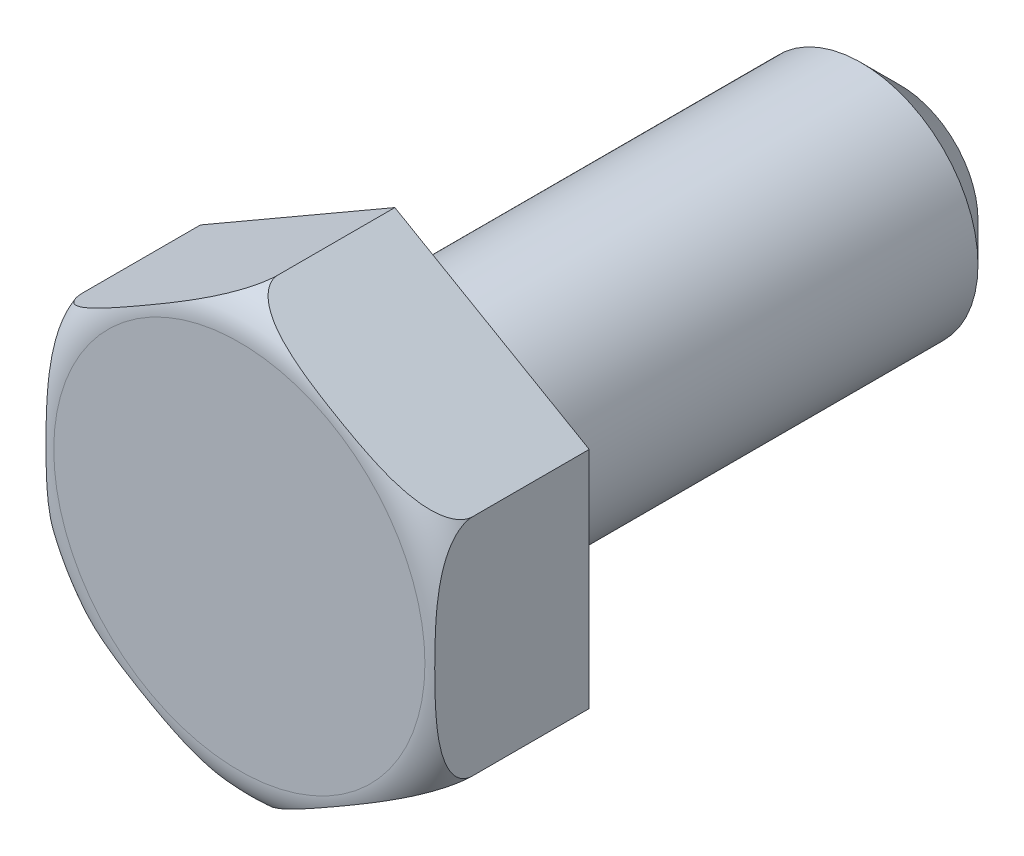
ISO-10303-21;
HEADER;
FILE_DESCRIPTION(('STEP AP214'),'2;1');
FILE_NAME('part.step','',(''),(''),'','','');
FILE_SCHEMA(('AUTOMOTIVE_DESIGN { 1 0 10303 214 1 1 1 1 }'));
ENDSEC;
DATA;
#1=APPLICATION_CONTEXT('core data for automotive mechanical design processes');
#2=APPLICATION_PROTOCOL_DEFINITION('international standard','automotive_design',2000,#1);
#3=PRODUCT_CONTEXT('',#1,'mechanical');
#4=PRODUCT('Part','Part','',(#3));
#5=PRODUCT_RELATED_PRODUCT_CATEGORY('part','',(#4));
#6=PRODUCT_DEFINITION_FORMATION('','',#4);
#7=PRODUCT_DEFINITION_CONTEXT('part definition',#1,'design');
#8=PRODUCT_DEFINITION('design','',#6,#7);
#9=PRODUCT_DEFINITION_SHAPE('','',#8);
#10=(LENGTH_UNIT() NAMED_UNIT(*) SI_UNIT(.MILLI.,.METRE.));
#11=(NAMED_UNIT(*) PLANE_ANGLE_UNIT() SI_UNIT($,.RADIAN.));
#12=(NAMED_UNIT(*) SI_UNIT($,.STERADIAN.) SOLID_ANGLE_UNIT());
#13=UNCERTAINTY_MEASURE_WITH_UNIT(LENGTH_MEASURE(1.E-05),#10,'distance_accuracy_value','');
#14=(GEOMETRIC_REPRESENTATION_CONTEXT(3) GLOBAL_UNCERTAINTY_ASSIGNED_CONTEXT((#13)) GLOBAL_UNIT_ASSIGNED_CONTEXT((#10,
#11,#12)) REPRESENTATION_CONTEXT('',''));
#15=CARTESIAN_POINT('',(0.,0.,0.));
#16=DIRECTION('',(0.,0.,1.));
#17=DIRECTION('',(1.,0.,0.));
#18=AXIS2_PLACEMENT_3D('',#15,#16,#17);
#19=CARTESIAN_POINT('',(-9.99999999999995,0.,0.));
#20=DIRECTION('',(0.,0.,1.));
#21=DIRECTION('',(0.999999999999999,0.,0.));
#22=AXIS2_PLACEMENT_3D('',#19,#20,#21);
#23=PLANE('',#22);
#24=DIRECTION('',(0.866025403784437,0.5,0.));
#25=VECTOR('',#24,1.);
#26=CARTESIAN_POINT('',(-4.99999999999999,2.88675134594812,0.));
#27=LINE('',#26,#25);
#28=CARTESIAN_POINT('',(-4.99999999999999,2.88675134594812,0.));
#29=VERTEX_POINT('',#28);
#30=CARTESIAN_POINT('',(0.,5.77350269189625,0.));
#31=VERTEX_POINT('',#30);
#32=EDGE_CURVE('E97',#29,#31,#27,.T.);
#33=ORIENTED_EDGE('',*,*,#32,.T.);
#34=DIRECTION('',(0.866025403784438,-0.500000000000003,0.));
#35=VECTOR('',#34,1.);
#36=CARTESIAN_POINT('',(0.,5.77350269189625,0.));
#37=LINE('',#36,#35);
#38=CARTESIAN_POINT('',(5.,2.8867513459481,0.));
#39=VERTEX_POINT('',#38);
#40=EDGE_CURVE('E103',#31,#39,#37,.T.);
#41=ORIENTED_EDGE('',*,*,#40,.T.);
#42=DIRECTION('',(0.,-1.,0.));
#43=VECTOR('',#42,1.);
#44=CARTESIAN_POINT('',(5.,2.8867513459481,0.));
#45=LINE('',#44,#43);
#46=CARTESIAN_POINT('',(4.99999999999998,-2.88675134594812,0.));
#47=VERTEX_POINT('',#46);
#48=EDGE_CURVE('E191',#39,#47,#45,.T.);
#49=ORIENTED_EDGE('',*,*,#48,.T.);
#50=DIRECTION('',(-0.86602540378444,-0.499999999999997,0.));
#51=VECTOR('',#50,1.);
#52=CARTESIAN_POINT('',(4.99999999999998,-2.88675134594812,0.));
#53=LINE('',#52,#51);
#54=CARTESIAN_POINT('',(0.,-5.77350269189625,0.));
#55=VERTEX_POINT('',#54);
#56=EDGE_CURVE('E192',#47,#55,#53,.T.);
#57=ORIENTED_EDGE('',*,*,#56,.T.);
#58=DIRECTION('',(-0.866025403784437,0.500000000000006,0.));
#59=VECTOR('',#58,1.);
#60=CARTESIAN_POINT('',(0.,-5.77350269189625,0.));
#61=LINE('',#60,#59);
#62=CARTESIAN_POINT('',(-5.,-2.8867513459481,0.));
#63=VERTEX_POINT('',#62);
#64=EDGE_CURVE('E110',#55,#63,#61,.T.);
#65=ORIENTED_EDGE('',*,*,#64,.T.);
#66=DIRECTION('',(0.,1.,0.));
#67=VECTOR('',#66,1.);
#68=CARTESIAN_POINT('',(-5.,-2.8867513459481,0.));
#69=LINE('',#68,#67);
#70=EDGE_CURVE('E105',#63,#29,#69,.T.);
#71=ORIENTED_EDGE('',*,*,#70,.T.);
#72=EDGE_LOOP('',(#33,#41,#49,#57,#65,#71));
#73=FACE_BOUND('',#72,.T.);
#74=CARTESIAN_POINT('',(0.,0.,0.));
#75=DIRECTION('',(0.,0.,-1.));
#76=DIRECTION('',(-0.999999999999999,0.,0.));
#77=AXIS2_PLACEMENT_3D('',#74,#75,#76);
#78=CIRCLE('',#77,3.);
#79=CARTESIAN_POINT('',(2.99999999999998,0.,0.));
#80=VERTEX_POINT('',#79);
#81=EDGE_CURVE('E119',#80,#80,#78,.T.);
#82=ORIENTED_EDGE('',*,*,#81,.F.);
#83=EDGE_LOOP('',(#82));
#84=FACE_BOUND('',#83,.T.);
#85=ADVANCED_FACE('F30',(#73,#84),#23,.F.);
#86=CARTESIAN_POINT('',(-5.,2.88675134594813,3.99999999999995));
#87=DIRECTION('',(-0.500000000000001,0.86602540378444,0.));
#88=DIRECTION('',(-0.866025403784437,-0.5,0.));
#89=AXIS2_PLACEMENT_3D('',#86,#87,#88);
#90=PLANE('',#89);
#91=DIRECTION('',(0.,0.,-1.));
#92=VECTOR('',#91,1.);
#93=CARTESIAN_POINT('',(-5.,2.88675134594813,3.99999999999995));
#94=LINE('',#93,#92);
#95=CARTESIAN_POINT('',(-5.,2.88675134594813,2.99999999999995));
#96=VERTEX_POINT('',#95);
#97=EDGE_CURVE('E54',#96,#29,#94,.T.);
#98=ORIENTED_EDGE('',*,*,#97,.F.);
#99=CARTESIAN_POINT('',(-4.99999996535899,2.88675136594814,2.99979999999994));
#100=CARTESIAN_POINT('',(-5.00006907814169,2.88671146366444,3.02964897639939));
#101=CARTESIAN_POINT('',(-4.9977095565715,2.88807373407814,3.0594276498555));
#102=CARTESIAN_POINT('',(-4.9886422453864,2.89330874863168,3.11784413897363));
#103=CARTESIAN_POINT('',(-4.9819708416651,2.89716048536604,3.14648939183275));
#104=CARTESIAN_POINT('',(-4.96479690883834,2.90707586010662,3.20208694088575));
#105=CARTESIAN_POINT('',(-4.95430462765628,2.91313358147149,3.22904354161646));
#106=CARTESIAN_POINT('',(-4.93013797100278,2.92708620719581,3.2810233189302));
#107=CARTESIAN_POINT('',(-4.91645660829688,2.93498514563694,3.30604208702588));
#108=CARTESIAN_POINT('',(-4.8771494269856,2.9576791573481,3.36901594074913));
#109=CARTESIAN_POINT('',(-4.84942080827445,2.97368828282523,3.40521883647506));
#110=CARTESIAN_POINT('',(-4.78944529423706,3.0083151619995,3.47221861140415));
#111=CARTESIAN_POINT('',(-4.75718692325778,3.02693954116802,3.50300129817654));
#112=CARTESIAN_POINT('',(-4.69466550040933,3.06303630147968,3.5555697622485));
#113=CARTESIAN_POINT('',(-4.6648090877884,3.08027390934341,3.5780128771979));
#114=CARTESIAN_POINT('',(-4.60352044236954,3.11565892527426,3.61984398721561));
#115=CARTESIAN_POINT('',(-4.57208700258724,3.13380703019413,3.63922959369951));
#116=CARTESIAN_POINT('',(-4.47603383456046,3.1892633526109,3.693443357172));
#117=CARTESIAN_POINT('',(-4.4097231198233,3.22754786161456,3.72427985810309));
#118=CARTESIAN_POINT('',(-4.29385125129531,3.2944465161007,3.77031310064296));
#119=CARTESIAN_POINT('',(-4.2448356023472,3.3227457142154,3.78746838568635));
#120=CARTESIAN_POINT('',(-4.14599413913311,3.37981185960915,3.81835998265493));
#121=CARTESIAN_POINT('',(-4.09616820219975,3.40857887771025,3.8320957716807));
#122=CARTESIAN_POINT('',(-3.94573332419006,3.49543249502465,3.86916194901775));
#123=CARTESIAN_POINT('',(-3.84435655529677,3.55396239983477,3.88828198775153));
#124=CARTESIAN_POINT('',(-3.64030411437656,3.67177213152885,3.91907365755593));
#125=CARTESIAN_POINT('',(-3.5376244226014,3.73105427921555,3.93070582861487));
#126=CARTESIAN_POINT('',(-3.33204784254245,3.84974397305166,3.94891757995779));
#127=CARTESIAN_POINT('',(-3.2291512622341,3.90915134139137,3.95550205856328));
#128=CARTESIAN_POINT('',(-3.0407767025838,4.01790944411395,3.96452486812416));
#129=CARTESIAN_POINT('',(-2.95531504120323,4.06725075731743,3.96747816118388));
#130=CARTESIAN_POINT('',(-2.78434734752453,4.16595900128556,3.97171908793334));
#131=CARTESIAN_POINT('',(-2.69884131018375,4.21532593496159,3.97300644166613));
#132=CARTESIAN_POINT('',(-2.52814483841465,4.3138775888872,3.97421534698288));
#133=CARTESIAN_POINT('',(-2.4429544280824,4.3630622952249,3.97414202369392));
#134=CARTESIAN_POINT('',(-2.27258757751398,4.46142364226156,3.97261960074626));
#135=CARTESIAN_POINT('',(-2.18741113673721,4.51060028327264,3.97117058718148));
#136=CARTESIAN_POINT('',(-1.98528038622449,4.62730052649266,3.96572408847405));
#137=CARTESIAN_POINT('',(-1.86833991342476,4.69481613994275,3.96097686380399));
#138=CARTESIAN_POINT('',(-1.63436346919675,4.82990250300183,3.94647523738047));
#139=CARTESIAN_POINT('',(-1.51732797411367,4.89747297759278,3.93670850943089));
#140=CARTESIAN_POINT('',(-1.33675326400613,5.00172783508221,3.91528371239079));
#141=CARTESIAN_POINT('',(-1.27296555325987,5.03855568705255,3.90648021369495));
#142=CARTESIAN_POINT('',(-1.14578404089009,5.11198396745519,3.8857046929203));
#143=CARTESIAN_POINT('',(-1.08239014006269,5.14858445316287,3.8737335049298));
#144=CARTESIAN_POINT('',(-0.956487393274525,5.22127443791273,3.84579001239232));
#145=CARTESIAN_POINT('',(-0.893976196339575,5.25736529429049,3.8298321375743));
#146=CARTESIAN_POINT('',(-0.770066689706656,5.32890448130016,3.79277458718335));
#147=CARTESIAN_POINT('',(-0.708668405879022,5.36435279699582,3.77167479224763));
#148=CARTESIAN_POINT('',(-0.602471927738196,5.42566536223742,3.72879696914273));
#149=CARTESIAN_POINT('',(-0.557253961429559,5.45177196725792,3.70842018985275));
#150=CARTESIAN_POINT('',(-0.468594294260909,5.502959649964,3.66310158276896));
#151=CARTESIAN_POINT('',(-0.425150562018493,5.52804190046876,3.63816516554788));
#152=CARTESIAN_POINT('',(-0.340527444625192,5.57689908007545,3.58248680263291));
#153=CARTESIAN_POINT('',(-0.299374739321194,5.6006586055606,3.55168981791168));
#154=CARTESIAN_POINT('',(-0.221485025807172,5.64562825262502,3.48335958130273));
#155=CARTESIAN_POINT('',(-0.184736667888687,5.66684492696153,3.44584429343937));
#156=CARTESIAN_POINT('',(-0.130841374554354,5.69796138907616,3.37876026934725));
#157=CARTESIAN_POINT('',(-0.111527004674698,5.70911254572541,3.35152592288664));
#158=CARTESIAN_POINT('',(-0.076561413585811,5.72929993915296,3.29401830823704));
#159=CARTESIAN_POINT('',(-0.0609106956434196,5.73833588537,3.26374462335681));
#160=CARTESIAN_POINT('',(-0.0342097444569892,5.75375168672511,3.20006991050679));
#161=CARTESIAN_POINT('',(-0.0232212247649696,5.7600959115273,3.16663368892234));
#162=CARTESIAN_POINT('',(-0.00729449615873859,5.76929121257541,3.09794637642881));
#163=CARTESIAN_POINT('',(-0.00233300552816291,5.77215573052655,3.0627028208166));
#164=CARTESIAN_POINT('',(-0.000209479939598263,5.77338174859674,3.0181494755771));
#165=CARTESIAN_POINT('',(7.65761883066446E-06,5.77350711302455,3.00897234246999));
#166=CARTESIAN_POINT('',(-3.46410400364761E-08,5.77350267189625,2.99979999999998));
#167=B_SPLINE_CURVE_WITH_KNOTS('',3,(#99,#100,#101,#102,#103,#104,#105,#106,#107,#108,#109,#110,
#111,#112,#113,#114,#115,#116,#117,#118,#119,#120,#121,#122,#123,#124,#125,#126,#127,#128,#129,
#130,#131,#132,#133,#134,#135,#136,#137,#138,#139,#140,#141,#142,#143,#144,#145,#146,#147,#148,
#149,#150,#151,#152,#153,#154,#155,#156,#157,#158,#159,#160,#161,#162,#163,#164,#165,#166),
.UNSPECIFIED.,.F.,.F.,(4,2,2,2,2,2,2,2,2,2,2,2,2,2,2,2,2,2,2,2,2,2,2,2,2,2,2,2,2,2,2,2,2,4),(0.,
0.0893082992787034,0.177872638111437,0.266201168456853,0.354725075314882,0.498885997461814,
0.643418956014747,0.766650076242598,0.889976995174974,1.13688731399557,1.31422171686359,
1.49158322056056,1.84699035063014,2.20425541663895,2.56117334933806,2.85733875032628,
3.15355391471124,3.44865358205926,3.74373478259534,4.14903405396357,4.55533339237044,
4.77782242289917,5.00025292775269,5.22188972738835,5.44353167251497,5.61150721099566,
5.77928470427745,5.94872345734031,6.11771573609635,6.22301263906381,6.32832399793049,
6.43498888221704,6.54124040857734,6.56876759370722),.UNSPECIFIED.);
#168=CARTESIAN_POINT('',(0.,5.77350269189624,2.99999999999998));
#169=VERTEX_POINT('',#168);
#170=EDGE_CURVE('E87',#96,#169,#167,.T.);
#171=ORIENTED_EDGE('',*,*,#170,.T.);
#172=DIRECTION('',(0.,0.,-1.));
#173=VECTOR('',#172,1.);
#174=CARTESIAN_POINT('',(0.,5.77350269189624,3.99999999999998));
#175=LINE('',#174,#173);
#176=EDGE_CURVE('E95',#169,#31,#175,.T.);
#177=ORIENTED_EDGE('',*,*,#176,.T.);
#178=ORIENTED_EDGE('',*,*,#32,.F.);
#179=EDGE_LOOP('',(#98,#171,#177,#178));
#180=FACE_BOUND('',#179,.T.);
#181=ADVANCED_FACE('F94',(#180),#90,.T.);
#182=CARTESIAN_POINT('',(-5.00000000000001,-2.8867513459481,4.00000000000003));
#183=DIRECTION('',(-0.999999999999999,0.,0.));
#184=DIRECTION('',(0.,-1.,0.));
#185=AXIS2_PLACEMENT_3D('',#182,#183,#184);
#186=PLANE('',#185);
#187=DIRECTION('',(0.,0.,-1.));
#188=VECTOR('',#187,1.);
#189=CARTESIAN_POINT('',(-5.00000000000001,-2.8867513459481,4.00000000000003));
#190=LINE('',#189,#188);
#191=CARTESIAN_POINT('',(-5.,-2.8867513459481,3.00000000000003));
#192=VERTEX_POINT('',#191);
#193=EDGE_CURVE('E117',#192,#63,#190,.T.);
#194=ORIENTED_EDGE('',*,*,#193,.F.);
#195=CARTESIAN_POINT('',(-5.,0.,3.97401179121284));
#196=CARTESIAN_POINT('',(-5.,0.0844341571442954,3.97401178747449));
#197=CARTESIAN_POINT('',(-5.,0.168868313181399,3.97352153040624));
#198=CARTESIAN_POINT('',(-4.99999999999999,0.337726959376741,3.9714754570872));
#199=CARTESIAN_POINT('',(-5.,0.422151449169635,3.96991960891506));
#200=CARTESIAN_POINT('',(-5.,0.591137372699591,3.96548244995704));
#201=CARTESIAN_POINT('',(-4.99999999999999,0.675698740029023,3.9625984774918));
#202=CARTESIAN_POINT('',(-4.99999999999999,0.844741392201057,3.955073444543));
#203=CARTESIAN_POINT('',(-4.99999999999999,0.929222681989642,3.95043250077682));
#204=CARTESIAN_POINT('',(-4.99999999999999,1.09690703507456,3.93885690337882));
#205=CARTESIAN_POINT('',(-4.99999999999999,1.18011217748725,3.93195352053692));
#206=CARTESIAN_POINT('',(-4.99999999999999,1.34620524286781,3.91505630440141));
#207=CARTESIAN_POINT('',(-4.99999999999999,1.4290932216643,3.90506304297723));
#208=CARTESIAN_POINT('',(-4.99999999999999,1.59404626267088,3.88100731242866));
#209=CARTESIAN_POINT('',(-4.99999999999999,1.67611301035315,3.8669566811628));
#210=CARTESIAN_POINT('',(-4.99999999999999,1.83912605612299,3.83348729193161));
#211=CARTESIAN_POINT('',(-5.,1.92007326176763,3.81407318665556));
#212=CARTESIAN_POINT('',(-4.99999999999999,2.03224253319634,3.78185941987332));
#213=CARTESIAN_POINT('',(-4.99999999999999,2.06431900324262,3.77202365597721));
#214=CARTESIAN_POINT('',(-4.99999999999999,2.1280503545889,3.751053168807));
#215=CARTESIAN_POINT('',(-4.99999999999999,2.1597051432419,3.73991816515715));
#216=CARTESIAN_POINT('',(-4.99999999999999,2.25405716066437,3.70426425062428));
#217=CARTESIAN_POINT('',(-5.00000000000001,2.31595956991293,3.67754676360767));
#218=CARTESIAN_POINT('',(-5.,2.43682926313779,3.6164458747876));
#219=CARTESIAN_POINT('',(-4.99999999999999,2.49575437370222,3.58197747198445));
#220=CARTESIAN_POINT('',(-4.99999999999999,2.60702764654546,3.50369615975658));
#221=CARTESIAN_POINT('',(-5.00000000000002,2.65940517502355,3.45992753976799));
#222=CARTESIAN_POINT('',(-5.,2.73003192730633,3.38527933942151));
#223=CARTESIAN_POINT('',(-4.99999999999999,2.75252278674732,3.3584264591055));
#224=CARTESIAN_POINT('',(-4.99999999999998,2.79340676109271,3.30171629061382));
#225=CARTESIAN_POINT('',(-4.99999999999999,2.81180090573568,3.2718597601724));
#226=CARTESIAN_POINT('',(-4.99999999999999,2.84343614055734,3.20903756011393));
#227=CARTESIAN_POINT('',(-4.99999999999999,2.85661473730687,3.17603973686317));
#228=CARTESIAN_POINT('',(-4.99999999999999,2.87620891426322,3.10809271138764));
#229=CARTESIAN_POINT('',(-4.99999999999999,2.88263520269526,3.07314669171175));
#230=CARTESIAN_POINT('',(-4.99999999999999,2.88763613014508,3.00734998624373));
#231=CARTESIAN_POINT('',(-4.99999999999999,2.88713555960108,2.9765679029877));
#232=CARTESIAN_POINT('',(-4.99999999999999,2.88054787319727,2.91560972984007));
#233=CARTESIAN_POINT('',(-4.99999999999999,2.87445989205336,2.88543373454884));
#234=CARTESIAN_POINT('',(-4.99999999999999,2.85783548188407,2.82860247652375));
#235=CARTESIAN_POINT('',(-4.99999999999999,2.84763164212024,2.80184755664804));
#236=CARTESIAN_POINT('',(-4.99999999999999,2.8235140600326,2.75008707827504));
#237=CARTESIAN_POINT('',(-5.,2.80959931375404,2.72508199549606));
#238=CARTESIAN_POINT('',(-5.00000000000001,2.76996329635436,2.6633610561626));
#239=CARTESIAN_POINT('',(-4.99999999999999,2.7420269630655,2.62806827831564));
#240=CARTESIAN_POINT('',(-4.99999999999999,2.68096443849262,2.56229682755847));
#241=CARTESIAN_POINT('',(-5.,2.64782369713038,2.53183214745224));
#242=CARTESIAN_POINT('',(-5.00000000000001,2.55531696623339,2.45689996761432));
#243=CARTESIAN_POINT('',(-5.,2.49291410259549,2.4162134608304));
#244=CARTESIAN_POINT('',(-4.99999999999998,2.36298619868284,2.3443368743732));
#245=CARTESIAN_POINT('',(-4.99999999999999,2.29545150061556,2.31316528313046));
#246=CARTESIAN_POINT('',(-4.99999999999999,2.13664382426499,2.24987195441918));
#247=CARTESIAN_POINT('',(-4.99999999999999,2.04436780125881,2.22031303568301));
#248=CARTESIAN_POINT('',(-4.99999999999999,1.85734995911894,2.17017461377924));
#249=CARTESIAN_POINT('',(-4.99999999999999,1.76260346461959,2.14961367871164));
#250=CARTESIAN_POINT('',(-4.99999999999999,1.57135169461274,2.11495213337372));
#251=CARTESIAN_POINT('',(-4.99999999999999,1.47483905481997,2.10089357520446));
#252=CARTESIAN_POINT('',(-5.,1.28134727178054,2.07758584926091));
#253=CARTESIAN_POINT('',(-5.00000000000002,1.18436859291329,2.06833261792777));
#254=CARTESIAN_POINT('',(-5.00000000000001,1.0042797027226,2.05434621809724));
#255=CARTESIAN_POINT('',(-5.,0.921203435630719,2.04915143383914));
#256=CARTESIAN_POINT('',(-4.99999999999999,0.754952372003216,2.04062661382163));
#257=CARTESIAN_POINT('',(-4.99999999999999,0.671777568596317,2.03729671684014));
#258=CARTESIAN_POINT('',(-5.,0.505342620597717,2.03203565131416));
#259=CARTESIAN_POINT('',(-5.,0.422082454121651,2.03010521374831));
#260=CARTESIAN_POINT('',(-5.,0.25554226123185,2.02734661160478));
#261=CARTESIAN_POINT('',(-5.,0.172262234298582,2.0265184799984));
#262=CARTESIAN_POINT('',(-5.,0.00615388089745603,2.02582870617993));
#263=CARTESIAN_POINT('',(-5.,-0.0766744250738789,2.02596180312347));
#264=CARTESIAN_POINT('',(-5.,-0.24232202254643,2.02720446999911));
#265=CARTESIAN_POINT('',(-5.,-0.325141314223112,2.02831401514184));
#266=CARTESIAN_POINT('',(-5.,-0.490725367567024,2.03168886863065));
#267=CARTESIAN_POINT('',(-5.,-0.573490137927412,2.03395372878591));
#268=CARTESIAN_POINT('',(-5.,-0.738963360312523,2.03997655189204));
#269=CARTESIAN_POINT('',(-5.,-0.821671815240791,2.04373443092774));
#270=CARTESIAN_POINT('',(-5.,-0.964412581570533,2.05194821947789));
#271=CARTESIAN_POINT('',(-5.,-1.0244710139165,2.05593346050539));
#272=CARTESIAN_POINT('',(-5.,-1.14448717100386,2.06521703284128));
#273=CARTESIAN_POINT('',(-5.,-1.2044448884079,2.07051545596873));
#274=CARTESIAN_POINT('',(-5.,-1.3847712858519,2.08888049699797));
#275=CARTESIAN_POINT('',(-5.,-1.50492749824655,2.10438494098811));
#276=CARTESIAN_POINT('',(-5.,-1.70108630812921,2.13789105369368));
#277=CARTESIAN_POINT('',(-5.,-1.77756950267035,2.15303547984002));
#278=CARTESIAN_POINT('',(-5.,-1.92943257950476,2.18861418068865));
#279=CARTESIAN_POINT('',(-5.00000000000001,-2.00481105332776,2.2090546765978));
#280=CARTESIAN_POINT('',(-5.00000000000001,-2.15282891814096,2.2565816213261));
#281=CARTESIAN_POINT('',(-5.,-2.22548536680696,2.28361373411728));
#282=CARTESIAN_POINT('',(-5.00000000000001,-2.36686500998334,2.34636944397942));
#283=CARTESIAN_POINT('',(-5.00000000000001,-2.43559990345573,2.3820653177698));
#284=CARTESIAN_POINT('',(-5.00000000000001,-2.54547416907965,2.45171830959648));
#285=CARTESIAN_POINT('',(-5.,-2.58848786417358,2.48268379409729));
#286=CARTESIAN_POINT('',(-5.00000000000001,-2.66929603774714,2.55082911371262));
#287=CARTESIAN_POINT('',(-5.00000000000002,-2.70710399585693,2.58799232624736));
#288=CARTESIAN_POINT('',(-5.00000000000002,-2.76288617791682,2.65501988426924));
#289=CARTESIAN_POINT('',(-5.00000000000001,-2.78318803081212,2.6829356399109));
#290=CARTESIAN_POINT('',(-5.,-2.81924698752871,2.74160589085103));
#291=CARTESIAN_POINT('',(-5.,-2.83500577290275,2.77235933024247));
#292=CARTESIAN_POINT('',(-5.,-2.86090483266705,2.8366041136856));
#293=CARTESIAN_POINT('',(-5.00000000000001,-2.87097965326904,2.87012245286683));
#294=CARTESIAN_POINT('',(-5.00000000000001,-2.88414570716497,2.93849693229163));
#295=CARTESIAN_POINT('',(-5.,-2.88724689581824,2.97335109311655));
#296=CARTESIAN_POINT('',(-5.,-2.88620974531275,3.03757447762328));
#297=CARTESIAN_POINT('',(-5.00000000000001,-2.88310875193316,3.06696510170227));
#298=CARTESIAN_POINT('',(-5.00000000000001,-2.8719454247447,3.12478447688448));
#299=CARTESIAN_POINT('',(-5.,-2.86388094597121,3.15321280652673));
#300=CARTESIAN_POINT('',(-5.,-2.84126242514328,3.21419261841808));
#301=CARTESIAN_POINT('',(-5.00000000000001,-2.82570660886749,3.24636970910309));
#302=CARTESIAN_POINT('',(-5.00000000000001,-2.7895680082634,3.30775247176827));
#303=CARTESIAN_POINT('',(-5.,-2.76897697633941,3.33695315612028));
#304=CARTESIAN_POINT('',(-5.,-2.71362532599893,3.40501543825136));
#305=CARTESIAN_POINT('',(-5.,-2.67671192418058,3.44211290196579));
#306=CARTESIAN_POINT('',(-5.00000000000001,-2.59768075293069,3.51021918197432));
#307=CARTESIAN_POINT('',(-5.00000000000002,-2.55555195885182,3.54121472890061));
#308=CARTESIAN_POINT('',(-5.00000000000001,-2.4729344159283,3.59472713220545));
#309=CARTESIAN_POINT('',(-5.00000000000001,-2.43280320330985,3.61780720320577));
#310=CARTESIAN_POINT('',(-5.,-2.35069140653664,3.66044742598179));
#311=CARTESIAN_POINT('',(-5.,-2.3087092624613,3.68000453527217));
#312=CARTESIAN_POINT('',(-5.00000000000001,-2.22341286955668,3.71612260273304));
#313=CARTESIAN_POINT('',(-5.00000000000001,-2.18009662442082,3.73267878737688));
#314=CARTESIAN_POINT('',(-5.,-2.09259393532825,3.76318870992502));
#315=CARTESIAN_POINT('',(-5.,-2.048407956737,3.77714379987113));
#316=CARTESIAN_POINT('',(-5.,-1.92375920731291,3.8131381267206));
#317=CARTESIAN_POINT('',(-5.,-1.84258257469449,3.8327016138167));
#318=CARTESIAN_POINT('',(-5.,-1.67909357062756,3.86641768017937));
#319=CARTESIAN_POINT('',(-5.,-1.59678028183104,3.88056558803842));
#320=CARTESIAN_POINT('',(-5.,-1.43132255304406,3.90477977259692));
#321=CARTESIAN_POINT('',(-5.,-1.34817637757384,3.91483388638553));
#322=CARTESIAN_POINT('',(-5.,-1.18156344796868,3.93182730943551));
#323=CARTESIAN_POINT('',(-5.,-1.0980966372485,3.93876604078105));
#324=CARTESIAN_POINT('',(-5.,-0.93007223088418,3.95038259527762));
#325=CARTESIAN_POINT('',(-5.,-0.845512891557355,3.95503421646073));
#326=CARTESIAN_POINT('',(-5.,-0.676313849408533,3.96257593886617));
#327=CARTESIAN_POINT('',(-5.,-0.591674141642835,3.96546592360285));
#328=CARTESIAN_POINT('',(-5.,-0.422533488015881,3.96991199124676));
#329=CARTESIAN_POINT('',(-5.,-0.338032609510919,3.97147077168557));
#330=CARTESIAN_POINT('',(-5.,-0.169021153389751,3.97352065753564));
#331=CARTESIAN_POINT('',(-5.,-0.0845105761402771,3.97401179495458));
#332=CARTESIAN_POINT('',(-5.,0.,3.97401179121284));
#333=B_SPLINE_CURVE_WITH_KNOTS('',3,(#195,#196,#197,#198,#199,#200,#201,#202,#203,#204,#205,
#206,#207,#208,#209,#210,#211,#212,#213,#214,#215,#216,#217,#218,#219,#220,#221,#222,#223,#224,
#225,#226,#227,#228,#229,#230,#231,#232,#233,#234,#235,#236,#237,#238,#239,#240,#241,#242,#243,
#244,#245,#246,#247,#248,#249,#250,#251,#252,#253,#254,#255,#256,#257,#258,#259,#260,#261,#262,
#263,#264,#265,#266,#267,#268,#269,#270,#271,#272,#273,#274,#275,#276,#277,#278,#279,#280,#281,
#282,#283,#284,#285,#286,#287,#288,#289,#290,#291,#292,#293,#294,#295,#296,#297,#298,#299,#300,
#301,#302,#303,#304,#305,#306,#307,#308,#309,#310,#311,#312,#313,#314,#315,#316,#317,#318,#319,
#320,#321,#322,#323,#324,#325,#326,#327,#328,#329,#330,#331,#332),.UNSPECIFIED.,.T.,.F.,(4,2,2,
2,2,2,2,2,2,2,2,2,2,2,2,2,2,2,2,2,2,2,2,2,2,2,2,2,2,2,2,2,2,2,2,2,2,2,2,2,2,2,2,2,2,2,2,2,2,2,2,
2,2,2,2,2,2,2,2,2,2,2,2,2,2,2,2,2,4),(0.,0.253300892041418,0.506609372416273,0.760427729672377,
1.01422922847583,1.26466109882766,1.51504664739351,1.76470892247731,2.0141552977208,
2.11478223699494,2.21543093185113,2.41729436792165,2.62149001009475,2.82473419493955,
2.92952596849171,3.03429137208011,3.14027661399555,3.24609352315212,3.33793667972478,
3.42979406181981,3.51537131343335,3.60097174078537,3.73523193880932,3.86987440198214,
4.09209490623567,4.31474449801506,4.60471876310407,4.89528862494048,5.1877122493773,
5.4798881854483,5.72957811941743,5.97928663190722,6.22912548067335,6.47897180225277,
6.72745174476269,6.97592537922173,7.22430269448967,7.47266605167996,7.65322303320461,
7.83379264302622,8.19692973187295,8.43070260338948,8.66475133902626,8.89693237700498,
9.12838003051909,9.28695047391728,9.44510226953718,9.5483197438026,9.65149896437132,
9.75584328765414,9.86003855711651,9.94825395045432,10.0365074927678,10.1431416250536,
10.249951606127,10.4060755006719,10.562535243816,10.7012177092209,10.8400193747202,
10.9790399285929,11.1179880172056,11.3682096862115,11.6186467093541,11.869822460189,
12.1210447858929,12.3750817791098,12.6291355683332,12.8826733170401,13.13620346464),.UNSPECIFIED.);
#334=EDGE_CURVE('E98',#192,#96,#333,.T.);
#335=ORIENTED_EDGE('',*,*,#334,.T.);
#336=ORIENTED_EDGE('',*,*,#97,.T.);
#337=ORIENTED_EDGE('',*,*,#70,.F.);
#338=EDGE_LOOP('',(#194,#335,#336,#337));
#339=FACE_BOUND('',#338,.T.);
#340=ADVANCED_FACE('F32',(#339),#186,.T.);
#341=CARTESIAN_POINT('',(0.,-5.77350269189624,3.99999999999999));
#342=DIRECTION('',(-0.500000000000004,-0.866025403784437,0.));
#343=DIRECTION('',(0.866025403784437,-0.500000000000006,0.));
#344=AXIS2_PLACEMENT_3D('',#341,#342,#343);
#345=PLANE('',#344);
#346=DIRECTION('',(0.,0.,-1.));
#347=VECTOR('',#346,1.);
#348=CARTESIAN_POINT('',(0.,-5.77350269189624,3.99999999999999));
#349=LINE('',#348,#347);
#350=CARTESIAN_POINT('',(0.,-5.77350269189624,3.));
#351=VERTEX_POINT('',#350);
#352=EDGE_CURVE('E115',#351,#55,#349,.T.);
#353=ORIENTED_EDGE('',*,*,#352,.F.);
#354=CARTESIAN_POINT('',(-3.4641043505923E-08,-5.77350267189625,2.9998));
#355=CARTESIAN_POINT('',(6.90781416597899E-05,-5.77354257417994,3.02964897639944));
#356=CARTESIAN_POINT('',(-0.00229044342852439,-5.77218030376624,3.05942764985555));
#357=CARTESIAN_POINT('',(-0.011357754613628,-5.76694528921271,3.11784413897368));
#358=CARTESIAN_POINT('',(-0.0180291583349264,-5.76309355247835,3.1464893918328));
#359=CARTESIAN_POINT('',(-0.0352030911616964,-5.75317817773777,3.20208694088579));
#360=CARTESIAN_POINT('',(-0.0456953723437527,-5.74712045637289,3.2290435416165));
#361=CARTESIAN_POINT('',(-0.0698620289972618,-5.73316783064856,3.28102331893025));
#362=CARTESIAN_POINT('',(-0.0835433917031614,-5.72526889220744,3.30604208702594));
#363=CARTESIAN_POINT('',(-0.122850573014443,-5.70257488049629,3.36901594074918));
#364=CARTESIAN_POINT('',(-0.150579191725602,-5.68656575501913,3.40521883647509));
#365=CARTESIAN_POINT('',(-0.210554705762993,-5.65193887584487,3.47221861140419));
#366=CARTESIAN_POINT('',(-0.242813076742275,-5.63331449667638,3.5030012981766));
#367=CARTESIAN_POINT('',(-0.305334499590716,-5.59721773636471,3.55556976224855));
#368=CARTESIAN_POINT('',(-0.335190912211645,-5.57998012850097,3.57801287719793));
#369=CARTESIAN_POINT('',(-0.396479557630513,-5.5445951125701,3.61984398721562));
#370=CARTESIAN_POINT('',(-0.427912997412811,-5.52644700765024,3.63922959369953));
#371=CARTESIAN_POINT('',(-0.523966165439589,-5.47099068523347,3.69344335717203));
#372=CARTESIAN_POINT('',(-0.590276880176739,-5.43270617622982,3.72427985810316));
#373=CARTESIAN_POINT('',(-0.706148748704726,-5.36580752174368,3.77031310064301));
#374=CARTESIAN_POINT('',(-0.755164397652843,-5.33750832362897,3.78746838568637));
#375=CARTESIAN_POINT('',(-0.854005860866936,-5.28044217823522,3.81835998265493));
#376=CARTESIAN_POINT('',(-0.903831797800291,-5.25167516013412,3.83209577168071));
#377=CARTESIAN_POINT('',(-1.05426667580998,-5.16482154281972,3.86916194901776));
#378=CARTESIAN_POINT('',(-1.15564344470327,-5.1062916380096,3.88828198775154));
#379=CARTESIAN_POINT('',(-1.35969588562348,-4.98848190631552,3.91907365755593));
#380=CARTESIAN_POINT('',(-1.46237557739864,-4.92919975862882,3.93070582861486));
#381=CARTESIAN_POINT('',(-1.66795215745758,-4.81051006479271,3.94891757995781));
#382=CARTESIAN_POINT('',(-1.77084873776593,-4.75110269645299,3.95550205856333));
#383=CARTESIAN_POINT('',(-1.95922329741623,-4.64234459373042,3.9645248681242));
#384=CARTESIAN_POINT('',(-2.0446849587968,-4.59300328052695,3.96747816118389));
#385=CARTESIAN_POINT('',(-2.2156526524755,-4.49429503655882,3.97171908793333));
#386=CARTESIAN_POINT('',(-2.30115868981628,-4.44492810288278,3.97300644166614));
#387=CARTESIAN_POINT('',(-2.47185516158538,-4.34637644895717,3.97421534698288));
#388=CARTESIAN_POINT('',(-2.55704557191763,-4.29719174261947,3.97414202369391));
#389=CARTESIAN_POINT('',(-2.72741242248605,-4.1988303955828,3.97261960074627));
#390=CARTESIAN_POINT('',(-2.81258886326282,-4.14965375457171,3.97117058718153));
#391=CARTESIAN_POINT('',(-3.01471961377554,-4.03295351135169,3.96572408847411));
#392=CARTESIAN_POINT('',(-3.13166008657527,-3.96543789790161,3.96097686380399));
#393=CARTESIAN_POINT('',(-3.36563653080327,-3.83035153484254,3.94647523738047));
#394=CARTESIAN_POINT('',(-3.48267202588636,-3.76278106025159,3.93670850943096));
#395=CARTESIAN_POINT('',(-3.66324673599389,-3.65852620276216,3.91528371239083));
#396=CARTESIAN_POINT('',(-3.72703444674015,-3.62169835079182,3.90648021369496));
#397=CARTESIAN_POINT('',(-3.85421595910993,-3.54827007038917,3.88570469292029));
#398=CARTESIAN_POINT('',(-3.91760985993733,-3.51166958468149,3.87373350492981));
#399=CARTESIAN_POINT('',(-4.0435126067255,-3.43897959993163,3.84579001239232));
#400=CARTESIAN_POINT('',(-4.10602380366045,-3.40288874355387,3.82983213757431));
#401=CARTESIAN_POINT('',(-4.22993331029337,-3.3313495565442,3.79277458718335));
#402=CARTESIAN_POINT('',(-4.29133159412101,-3.29590124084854,3.77167479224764));
#403=CARTESIAN_POINT('',(-4.39752807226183,-3.23458867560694,3.72879696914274));
#404=CARTESIAN_POINT('',(-4.44274603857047,-3.20848207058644,3.70842018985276));
#405=CARTESIAN_POINT('',(-4.53140570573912,-3.15729438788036,3.66310158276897));
#406=CARTESIAN_POINT('',(-4.57484943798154,-3.1322121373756,3.63816516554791));
#407=CARTESIAN_POINT('',(-4.65947255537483,-3.08335495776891,3.58248680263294));
#408=CARTESIAN_POINT('',(-4.70062526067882,-3.05959543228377,3.5516898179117));
#409=CARTESIAN_POINT('',(-4.77851497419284,-3.01462578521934,3.48335958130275));
#410=CARTESIAN_POINT('',(-4.81526333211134,-2.99340911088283,3.4458442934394));
#411=CARTESIAN_POINT('',(-4.86915862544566,-2.9622926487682,3.37876026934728));
#412=CARTESIAN_POINT('',(-4.88847299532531,-2.95114149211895,3.35152592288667));
#413=CARTESIAN_POINT('',(-4.92343858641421,-2.93095409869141,3.29401830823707));
#414=CARTESIAN_POINT('',(-4.93908930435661,-2.92191815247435,3.26374462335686));
#415=CARTESIAN_POINT('',(-4.96579025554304,-2.90650235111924,3.20006991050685));
#416=CARTESIAN_POINT('',(-4.97677877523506,-2.90015812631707,3.1666336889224));
#417=CARTESIAN_POINT('',(-4.99270550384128,-2.89096282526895,3.09794637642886));
#418=CARTESIAN_POINT('',(-4.99766699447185,-2.8880983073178,3.06270282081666));
#419=CARTESIAN_POINT('',(-4.99979052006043,-2.88687228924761,3.01814947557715));
#420=CARTESIAN_POINT('',(-5.00000765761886,-2.8867469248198,3.00897234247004));
#421=CARTESIAN_POINT('',(-4.99999996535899,-2.8867513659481,2.99980000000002));
#422=B_SPLINE_CURVE_WITH_KNOTS('',3,(#354,#355,#356,#357,#358,#359,#360,#361,#362,#363,#364,
#365,#366,#367,#368,#369,#370,#371,#372,#373,#374,#375,#376,#377,#378,#379,#380,#381,#382,#383,
#384,#385,#386,#387,#388,#389,#390,#391,#392,#393,#394,#395,#396,#397,#398,#399,#400,#401,#402,
#403,#404,#405,#406,#407,#408,#409,#410,#411,#412,#413,#414,#415,#416,#417,#418,#419,#420,#421),
.UNSPECIFIED.,.F.,.F.,(4,2,2,2,2,2,2,2,2,2,2,2,2,2,2,2,2,2,2,2,2,2,2,2,2,2,2,2,2,2,2,2,2,4),(0.,
0.0893082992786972,0.177872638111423,0.266201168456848,0.354725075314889,0.498885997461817,
0.643418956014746,0.766650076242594,0.88997699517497,1.13688731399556,1.31422171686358,
1.49158322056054,1.84699035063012,2.20425541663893,2.56117334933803,2.85733875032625,
3.15355391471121,3.44865358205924,3.74373478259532,4.14903405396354,4.55533339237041,
4.77782242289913,5.00025292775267,5.22188972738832,5.44353167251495,5.61150721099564,
5.77928470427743,5.94872345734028,6.11771573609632,6.22301263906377,6.32832399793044,
6.43498888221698,6.54124040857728,6.56876759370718),.UNSPECIFIED.);
#423=EDGE_CURVE('E160',#351,#192,#422,.T.);
#424=ORIENTED_EDGE('',*,*,#423,.T.);
#425=ORIENTED_EDGE('',*,*,#193,.T.);
#426=ORIENTED_EDGE('',*,*,#64,.F.);
#427=EDGE_LOOP('',(#353,#424,#425,#426));
#428=FACE_BOUND('',#427,.T.);
#429=ADVANCED_FACE('F202',(#428),#345,.T.);
#430=CARTESIAN_POINT('',(4.99999999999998,-2.88675134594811,4.));
#431=DIRECTION('',(0.499999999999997,-0.866025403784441,0.));
#432=DIRECTION('',(0.86602540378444,0.499999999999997,0.));
#433=AXIS2_PLACEMENT_3D('',#430,#431,#432);
#434=PLANE('',#433);
#435=DIRECTION('',(0.,0.,-1.));
#436=VECTOR('',#435,1.);
#437=CARTESIAN_POINT('',(4.99999999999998,-2.88675134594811,4.));
#438=LINE('',#437,#436);
#439=CARTESIAN_POINT('',(4.99999999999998,-2.88675134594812,3.));
#440=VERTEX_POINT('',#439);
#441=EDGE_CURVE('E107',#440,#47,#438,.T.);
#442=ORIENTED_EDGE('',*,*,#441,.F.);
#443=CARTESIAN_POINT('',(4.99999996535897,-2.88675136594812,2.9998));
#444=CARTESIAN_POINT('',(5.00006907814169,-2.88671146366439,3.02964897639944));
#445=CARTESIAN_POINT('',(4.99770955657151,-2.8880737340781,3.05942764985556));
#446=CARTESIAN_POINT('',(4.98864224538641,-2.89330874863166,3.11784413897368));
#447=CARTESIAN_POINT('',(4.98197084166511,-2.89716048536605,3.1464893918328));
#448=CARTESIAN_POINT('',(4.96479690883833,-2.90707586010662,3.20208694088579));
#449=CARTESIAN_POINT('',(4.95430462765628,-2.91313358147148,3.22904354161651));
#450=CARTESIAN_POINT('',(4.93013797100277,-2.92708620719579,3.28102331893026));
#451=CARTESIAN_POINT('',(4.91645660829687,-2.93498514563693,3.30604208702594));
#452=CARTESIAN_POINT('',(4.87714942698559,-2.95767915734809,3.36901594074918));
#453=CARTESIAN_POINT('',(4.84942080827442,-2.97368828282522,3.4052188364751));
#454=CARTESIAN_POINT('',(4.78944529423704,-3.0083151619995,3.4722186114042));
#455=CARTESIAN_POINT('',(4.75718692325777,-3.02693954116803,3.5030012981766));
#456=CARTESIAN_POINT('',(4.69466550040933,-3.0630363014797,3.55556976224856));
#457=CARTESIAN_POINT('',(4.66480908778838,-3.08027390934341,3.57801287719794));
#458=CARTESIAN_POINT('',(4.6035204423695,-3.11565892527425,3.61984398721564));
#459=CARTESIAN_POINT('',(4.5720870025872,-3.13380703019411,3.63922959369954));
#460=CARTESIAN_POINT('',(4.47603383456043,-3.18926335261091,3.69344335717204));
#461=CARTESIAN_POINT('',(4.40972311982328,-3.22754786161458,3.72427985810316));
#462=CARTESIAN_POINT('',(4.29385125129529,-3.29444651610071,3.77031310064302));
#463=CARTESIAN_POINT('',(4.24483560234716,-3.3227457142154,3.78746838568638));
#464=CARTESIAN_POINT('',(4.14599413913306,-3.37981185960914,3.81835998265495));
#465=CARTESIAN_POINT('',(4.0961682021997,-3.40857887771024,3.83209577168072));
#466=CARTESIAN_POINT('',(3.94573332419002,-3.49543249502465,3.86916194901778));
#467=CARTESIAN_POINT('',(3.84435655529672,-3.55396239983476,3.88828198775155));
#468=CARTESIAN_POINT('',(3.64030411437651,-3.67177213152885,3.91907365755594));
#469=CARTESIAN_POINT('',(3.53762442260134,-3.73105427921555,3.93070582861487));
#470=CARTESIAN_POINT('',(3.3320478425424,-3.84974397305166,3.94891757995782));
#471=CARTESIAN_POINT('',(3.22915126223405,-3.90915134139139,3.95550205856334));
#472=CARTESIAN_POINT('',(3.04077670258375,-4.01790944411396,3.96452486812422));
#473=CARTESIAN_POINT('',(2.95531504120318,-4.06725075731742,3.9674781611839));
#474=CARTESIAN_POINT('',(2.78434734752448,-4.16595900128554,3.97171908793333));
#475=CARTESIAN_POINT('',(2.69884131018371,-4.21532593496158,3.97300644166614));
#476=CARTESIAN_POINT('',(2.52814483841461,-4.31387758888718,3.97421534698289));
#477=CARTESIAN_POINT('',(2.44295442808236,-4.36306229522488,3.97414202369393));
#478=CARTESIAN_POINT('',(2.27258757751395,-4.46142364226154,3.97261960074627));
#479=CARTESIAN_POINT('',(2.18741113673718,-4.51060028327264,3.97117058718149));
#480=CARTESIAN_POINT('',(1.98528038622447,-4.62730052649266,3.96572408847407));
#481=CARTESIAN_POINT('',(1.86833991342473,-4.69481613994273,3.96097686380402));
#482=CARTESIAN_POINT('',(1.63436346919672,-4.8299025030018,3.94647523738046));
#483=CARTESIAN_POINT('',(1.51732797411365,-4.89747297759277,3.93670850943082));
#484=CARTESIAN_POINT('',(1.3367532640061,-5.00172783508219,3.91528371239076));
#485=CARTESIAN_POINT('',(1.27296555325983,-5.03855568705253,3.90648021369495));
#486=CARTESIAN_POINT('',(1.14578404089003,-5.11198396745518,3.88570469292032));
#487=CARTESIAN_POINT('',(1.08239014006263,-5.14858445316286,3.87373350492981));
#488=CARTESIAN_POINT('',(0.956487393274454,-5.22127443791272,3.84579001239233));
#489=CARTESIAN_POINT('',(0.893976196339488,-5.25736529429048,3.82983213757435));
#490=CARTESIAN_POINT('',(0.77006668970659,-5.32890448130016,3.79277458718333));
#491=CARTESIAN_POINT('',(0.708668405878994,-5.36435279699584,3.77167479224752));
#492=CARTESIAN_POINT('',(0.602471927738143,-5.42566536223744,3.72879696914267));
#493=CARTESIAN_POINT('',(0.557253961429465,-5.45177196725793,3.70842018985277));
#494=CARTESIAN_POINT('',(0.468594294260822,-5.502959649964,3.66310158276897));
#495=CARTESIAN_POINT('',(0.425150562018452,-5.52804190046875,3.6381651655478));
#496=CARTESIAN_POINT('',(0.340527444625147,-5.57689908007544,3.58248680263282));
#497=CARTESIAN_POINT('',(0.299374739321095,-5.6006586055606,3.55168981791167));
#498=CARTESIAN_POINT('',(0.221485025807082,-5.64562825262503,3.48335958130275));
#499=CARTESIAN_POINT('',(0.184736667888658,-5.66684492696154,3.44584429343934));
#500=CARTESIAN_POINT('',(0.130841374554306,-5.69796138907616,3.37876026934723));
#501=CARTESIAN_POINT('',(0.111527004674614,-5.70911254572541,3.35152592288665));
#502=CARTESIAN_POINT('',(0.0765614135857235,-5.72929993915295,3.29401830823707));
#503=CARTESIAN_POINT('',(0.0609106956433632,-5.73833588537,3.26374462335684));
#504=CARTESIAN_POINT('',(0.0342097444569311,-5.75375168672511,3.20006991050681));
#505=CARTESIAN_POINT('',(0.0232212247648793,-5.7600959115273,3.16663368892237));
#506=CARTESIAN_POINT('',(0.00729449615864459,-5.76929121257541,3.09794637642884));
#507=CARTESIAN_POINT('',(0.00233300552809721,-5.77215573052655,3.06270282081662));
#508=CARTESIAN_POINT('',(0.000209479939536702,-5.77338174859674,3.01814947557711));
#509=CARTESIAN_POINT('',(-7.65761889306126E-06,-5.77350711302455,3.00897234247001));
#510=CARTESIAN_POINT('',(3.4640974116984E-08,-5.77350267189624,2.9998));
#511=B_SPLINE_CURVE_WITH_KNOTS('',3,(#443,#444,#445,#446,#447,#448,#449,#450,#451,#452,#453,
#454,#455,#456,#457,#458,#459,#460,#461,#462,#463,#464,#465,#466,#467,#468,#469,#470,#471,#472,
#473,#474,#475,#476,#477,#478,#479,#480,#481,#482,#483,#484,#485,#486,#487,#488,#489,#490,#491,
#492,#493,#494,#495,#496,#497,#498,#499,#500,#501,#502,#503,#504,#505,#506,#507,#508,#509,#510),
.UNSPECIFIED.,.F.,.F.,(4,2,2,2,2,2,2,2,2,2,2,2,2,2,2,2,2,2,2,2,2,2,2,2,2,2,2,2,2,2,2,2,2,4),(0.,
0.0893082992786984,0.177872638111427,0.26620116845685,0.354725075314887,0.49888599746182,
0.643418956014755,0.766650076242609,0.889976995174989,1.13688731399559,1.31422171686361,
1.49158322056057,1.84699035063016,2.20425541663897,2.56117334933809,2.8573387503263,
3.15355391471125,3.44865358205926,3.74373478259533,4.14903405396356,4.55533339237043,
4.77782242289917,5.00025292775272,5.22188972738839,5.44353167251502,5.61150721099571,
5.7792847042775,5.94872345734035,6.11771573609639,6.22301263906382,6.32832399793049,
6.43498888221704,6.54124040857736,6.56876759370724),.UNSPECIFIED.);
#512=EDGE_CURVE('E154',#440,#351,#511,.T.);
#513=ORIENTED_EDGE('',*,*,#512,.T.);
#514=ORIENTED_EDGE('',*,*,#352,.T.);
#515=ORIENTED_EDGE('',*,*,#56,.F.);
#516=EDGE_LOOP('',(#442,#513,#514,#515));
#517=FACE_BOUND('',#516,.T.);
#518=ADVANCED_FACE('F208',(#517),#434,.T.);
#519=CARTESIAN_POINT('',(5.00000000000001,2.8867513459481,3.99999999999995));
#520=DIRECTION('',(0.999999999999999,0.,0.));
#521=DIRECTION('',(0.,1.,0.));
#522=AXIS2_PLACEMENT_3D('',#519,#520,#521);
#523=PLANE('',#522);
#524=DIRECTION('',(0.,0.,-1.));
#525=VECTOR('',#524,1.);
#526=CARTESIAN_POINT('',(5.00000000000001,2.8867513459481,3.99999999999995));
#527=LINE('',#526,#525);
#528=CARTESIAN_POINT('',(5.00000000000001,2.88675134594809,2.99999999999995));
#529=VERTEX_POINT('',#528);
#530=EDGE_CURVE('E104',#529,#39,#527,.T.);
#531=ORIENTED_EDGE('',*,*,#530,.F.);
#532=CARTESIAN_POINT('',(5.00000000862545,0.,3.97401179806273));
#533=CARTESIAN_POINT('',(5.00000000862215,-0.084434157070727,3.97401179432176));
#534=CARTESIAN_POINT('',(5.00000000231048,-0.168868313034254,3.97352153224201));
#535=CARTESIAN_POINT('',(4.99999999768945,-0.33772695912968,3.97147545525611));
#536=CARTESIAN_POINT('',(4.99999999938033,-0.422151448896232,3.96991960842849));
#537=CARTESIAN_POINT('',(5.00000000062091,-0.591137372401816,3.96548245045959));
#538=CARTESIAN_POINT('',(5.00000000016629,-0.675698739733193,3.962598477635));
#539=CARTESIAN_POINT('',(4.99999999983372,-0.844741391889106,3.95507344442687));
#540=CARTESIAN_POINT('',(4.99999999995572,-0.929222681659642,3.95043250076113));
#541=CARTESIAN_POINT('',(5.00000000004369,-1.09690703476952,3.93885690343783));
#542=CARTESIAN_POINT('',(5.0000000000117,-1.18011217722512,3.93195352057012));
#543=CARTESIAN_POINT('',(4.9999999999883,-1.34620524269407,3.91505630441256));
#544=CARTESIAN_POINT('',(4.99999999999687,-1.42909322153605,3.90506304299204));
#545=CARTESIAN_POINT('',(5.00000000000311,-1.59404626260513,3.88100731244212));
#546=CARTESIAN_POINT('',(5.0000000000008,-1.67611301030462,3.86695668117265));
#547=CARTESIAN_POINT('',(4.99999999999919,-1.83912605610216,3.83348729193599));
#548=CARTESIAN_POINT('',(4.99999999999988,-1.92007326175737,3.81407318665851));
#549=CARTESIAN_POINT('',(5.00000000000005,-2.03224253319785,3.78185941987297));
#550=CARTESIAN_POINT('',(5.00000000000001,-2.06431900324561,3.77202365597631));
#551=CARTESIAN_POINT('',(4.99999999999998,-2.12805035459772,3.75105316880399));
#552=CARTESIAN_POINT('',(4.99999999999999,-2.15970514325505,3.73991816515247));
#553=CARTESIAN_POINT('',(5.,-2.25405716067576,3.70426425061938));
#554=CARTESIAN_POINT('',(4.99999999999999,-2.31595956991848,3.67754676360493));
#555=CARTESIAN_POINT('',(4.99999999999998,-2.43682926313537,3.61644587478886));
#556=CARTESIAN_POINT('',(4.99999999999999,-2.4957543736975,3.58197747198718));
#557=CARTESIAN_POINT('',(4.99999999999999,-2.60702764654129,3.50369615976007));
#558=CARTESIAN_POINT('',(4.99999999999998,-2.65940517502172,3.45992753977));
#559=CARTESIAN_POINT('',(4.99999999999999,-2.73003192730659,3.38527933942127));
#560=CARTESIAN_POINT('',(5.,-2.7525227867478,3.3584264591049));
#561=CARTESIAN_POINT('',(4.99999999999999,-2.7934067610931,3.30171629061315));
#562=CARTESIAN_POINT('',(4.99999999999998,-2.81180090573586,3.27185976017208));
#563=CARTESIAN_POINT('',(4.99999999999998,-2.84343614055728,3.2090375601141));
#564=CARTESIAN_POINT('',(4.99999999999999,-2.85661473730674,3.17603973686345));
#565=CARTESIAN_POINT('',(4.99999999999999,-2.87620891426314,3.10809271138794));
#566=CARTESIAN_POINT('',(4.99999999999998,-2.88263520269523,3.07314669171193));
#567=CARTESIAN_POINT('',(4.99999999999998,-2.88763613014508,3.00734998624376));
#568=CARTESIAN_POINT('',(4.99999999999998,-2.88713555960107,2.97656790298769));
#569=CARTESIAN_POINT('',(5.,-2.88054787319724,2.91560972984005));
#570=CARTESIAN_POINT('',(5.00000000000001,-2.87445989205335,2.88543373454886));
#571=CARTESIAN_POINT('',(5.00000000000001,-2.85783548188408,2.8286024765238));
#572=CARTESIAN_POINT('',(5.,-2.84763164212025,2.8018475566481));
#573=CARTESIAN_POINT('',(4.99999999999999,-2.82351406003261,2.7500870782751));
#574=CARTESIAN_POINT('',(4.99999999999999,-2.80959931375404,2.72508199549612));
#575=CARTESIAN_POINT('',(5.,-2.76996329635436,2.66336105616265));
#576=CARTESIAN_POINT('',(5.,-2.74202696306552,2.62806827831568));
#577=CARTESIAN_POINT('',(4.99999999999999,-2.68096443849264,2.56229682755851));
#578=CARTESIAN_POINT('',(4.99999999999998,-2.64782369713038,2.53183214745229));
#579=CARTESIAN_POINT('',(4.99999999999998,-2.55531696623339,2.45689996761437));
#580=CARTESIAN_POINT('',(4.99999999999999,-2.49291410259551,2.41621346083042));
#581=CARTESIAN_POINT('',(4.99999999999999,-2.36298619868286,2.34433687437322));
#582=CARTESIAN_POINT('',(4.99999999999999,-2.29545150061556,2.31316528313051));
#583=CARTESIAN_POINT('',(4.99999999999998,-2.13664382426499,2.24987195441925));
#584=CARTESIAN_POINT('',(4.99999999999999,-2.04436780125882,2.22031303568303));
#585=CARTESIAN_POINT('',(5.,-1.85734995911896,2.17017461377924));
#586=CARTESIAN_POINT('',(5.,-1.76260346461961,2.14961367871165));
#587=CARTESIAN_POINT('',(5.,-1.57135169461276,2.11495213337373));
#588=CARTESIAN_POINT('',(5.,-1.47483905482,2.10089357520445));
#589=CARTESIAN_POINT('',(4.99999999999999,-1.28134727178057,2.07758584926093));
#590=CARTESIAN_POINT('',(4.99999999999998,-1.18436859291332,2.06833261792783));
#591=CARTESIAN_POINT('',(4.99999999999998,-1.00427970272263,2.05434621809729));
#592=CARTESIAN_POINT('',(4.99999999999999,-0.92120343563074,2.04915143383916));
#593=CARTESIAN_POINT('',(5.,-0.75495237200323,2.04062661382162));
#594=CARTESIAN_POINT('',(5.,-0.671777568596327,2.03729671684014));
#595=CARTESIAN_POINT('',(5.,-0.505342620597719,2.03203565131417));
#596=CARTESIAN_POINT('',(5.,-0.42208245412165,2.03010521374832));
#597=CARTESIAN_POINT('',(5.,-0.255542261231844,2.02734661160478));
#598=CARTESIAN_POINT('',(5.,-0.172262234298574,2.0265184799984));
#599=CARTESIAN_POINT('',(5.,-0.00615388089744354,2.02582870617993));
#600=CARTESIAN_POINT('',(5.,0.0766744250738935,2.02596180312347));
#601=CARTESIAN_POINT('',(5.,0.242322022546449,2.02720446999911));
#602=CARTESIAN_POINT('',(5.,0.325141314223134,2.02831401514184));
#603=CARTESIAN_POINT('',(5.,0.490725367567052,2.03168886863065));
#604=CARTESIAN_POINT('',(5.,0.573490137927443,2.0339537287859));
#605=CARTESIAN_POINT('',(5.,0.738963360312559,2.03997655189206));
#606=CARTESIAN_POINT('',(5.,0.821671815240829,2.04373443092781));
#607=CARTESIAN_POINT('',(5.,0.964412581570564,2.05194821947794));
#608=CARTESIAN_POINT('',(5.,1.02447101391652,2.05593346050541));
#609=CARTESIAN_POINT('',(5.00000000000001,1.14448717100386,2.06521703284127));
#610=CARTESIAN_POINT('',(5.00000000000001,1.20444488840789,2.07051545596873));
#611=CARTESIAN_POINT('',(5.,1.38477128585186,2.08888049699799));
#612=CARTESIAN_POINT('',(4.99999999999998,1.50492749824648,2.10438494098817));
#613=CARTESIAN_POINT('',(4.99999999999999,1.70108630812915,2.13789105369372));
#614=CARTESIAN_POINT('',(5.,1.77756950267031,2.15303547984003));
#615=CARTESIAN_POINT('',(5.00000000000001,1.92943257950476,2.18861418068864));
#616=CARTESIAN_POINT('',(5.00000000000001,2.00481105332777,2.20905467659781));
#617=CARTESIAN_POINT('',(5.00000000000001,2.152828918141,2.25658162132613));
#618=CARTESIAN_POINT('',(5.00000000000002,2.225485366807,2.28361373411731));
#619=CARTESIAN_POINT('',(5.,2.3668650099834,2.34636944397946));
#620=CARTESIAN_POINT('',(4.99999999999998,2.4355999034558,2.38206531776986));
#621=CARTESIAN_POINT('',(4.99999999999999,2.54547416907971,2.45171830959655));
#622=CARTESIAN_POINT('',(5.00000000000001,2.58848786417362,2.48268379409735));
#623=CARTESIAN_POINT('',(5.00000000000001,2.66929603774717,2.55082911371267));
#624=CARTESIAN_POINT('',(4.99999999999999,2.70710399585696,2.58799232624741));
#625=CARTESIAN_POINT('',(4.99999999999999,2.76288617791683,2.65501988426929));
#626=CARTESIAN_POINT('',(5.00000000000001,2.78318803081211,2.68293563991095));
#627=CARTESIAN_POINT('',(5.00000000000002,2.81924698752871,2.74160589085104));
#628=CARTESIAN_POINT('',(5.00000000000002,2.83500577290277,2.77235933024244));
#629=CARTESIAN_POINT('',(5.00000000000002,2.86090483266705,2.83660411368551));
#630=CARTESIAN_POINT('',(5.00000000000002,2.87097965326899,2.8701224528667));
#631=CARTESIAN_POINT('',(5.00000000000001,2.88414570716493,2.9384969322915));
#632=CARTESIAN_POINT('',(5.,2.88724689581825,2.97335109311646));
#633=CARTESIAN_POINT('',(5.,2.88620974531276,3.03757447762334));
#634=CARTESIAN_POINT('',(5.00000000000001,2.88310875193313,3.06696510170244));
#635=CARTESIAN_POINT('',(5.00000000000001,2.87194542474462,3.12478447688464));
#636=CARTESIAN_POINT('',(5.00000000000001,2.86388094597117,3.15321280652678));
#637=CARTESIAN_POINT('',(5.,2.84126242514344,3.2141926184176));
#638=CARTESIAN_POINT('',(5.00000000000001,2.82570660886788,3.24636970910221));
#639=CARTESIAN_POINT('',(5.00000000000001,2.78956800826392,3.30775247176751));
#640=CARTESIAN_POINT('',(5.00000000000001,2.76897697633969,3.33695315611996));
#641=CARTESIAN_POINT('',(5.00000000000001,2.71362532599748,3.40501543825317));
#642=CARTESIAN_POINT('',(5.00000000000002,2.67671192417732,3.44211290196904));
#643=CARTESIAN_POINT('',(5.00000000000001,2.59768075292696,3.51021918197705));
#644=CARTESIAN_POINT('',(4.99999999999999,2.55555195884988,3.54121472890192));
#645=CARTESIAN_POINT('',(4.99999999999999,2.47293441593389,3.59472713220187));
#646=CARTESIAN_POINT('',(5.,2.43280320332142,3.61780720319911));
#647=CARTESIAN_POINT('',(5.00000000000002,2.35069140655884,3.66044742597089));
#648=CARTESIAN_POINT('',(5.00000000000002,2.30870926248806,3.68000453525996));
#649=CARTESIAN_POINT('',(5.,2.22341286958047,3.71612260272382));
#650=CARTESIAN_POINT('',(4.99999999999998,2.18009662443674,3.73267878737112));
#651=CARTESIAN_POINT('',(5.00000000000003,2.09259393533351,3.76318870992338));
#652=CARTESIAN_POINT('',(5.0000000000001,2.0484079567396,3.7771437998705));
#653=CARTESIAN_POINT('',(4.99999999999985,1.92375920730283,3.81313812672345));
#654=CARTESIAN_POINT('',(4.99999999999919,1.84258257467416,3.83270161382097));
#655=CARTESIAN_POINT('',(5.00000000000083,1.67909357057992,3.86641768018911));
#656=CARTESIAN_POINT('',(5.00000000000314,1.59678028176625,3.88056558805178));
#657=CARTESIAN_POINT('',(4.99999999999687,1.43132255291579,3.90477977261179));
#658=CARTESIAN_POINT('',(4.99999999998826,1.34817637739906,3.91483388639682));
#659=CARTESIAN_POINT('',(5.00000000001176,1.18156344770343,3.93182730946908));
#660=CARTESIAN_POINT('',(5.00000000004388,1.09809663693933,3.93876604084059));
#661=CARTESIAN_POINT('',(4.99999999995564,0.930072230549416,3.95038259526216));
#662=CARTESIAN_POINT('',(4.99999999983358,0.845512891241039,3.95503421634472));
#663=CARTESIAN_POINT('',(5.00000000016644,0.676313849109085,3.96257593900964));
#664=CARTESIAN_POINT('',(5.00000000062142,0.591674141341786,3.96546592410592));
#665=CARTESIAN_POINT('',(4.99999999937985,0.422533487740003,3.96991199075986));
#666=CARTESIAN_POINT('',(4.99999999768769,0.338032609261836,3.97147076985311));
#667=CARTESIAN_POINT('',(5.00000000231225,0.169021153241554,3.97352065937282));
#668=CARTESIAN_POINT('',(5.00000000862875,0.0845105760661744,3.97401180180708));
#669=CARTESIAN_POINT('',(5.00000000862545,0.,3.97401179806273));
#670=B_SPLINE_CURVE_WITH_KNOTS('',3,(#532,#533,#534,#535,#536,#537,#538,#539,#540,#541,#542,
#543,#544,#545,#546,#547,#548,#549,#550,#551,#552,#553,#554,#555,#556,#557,#558,#559,#560,#561,
#562,#563,#564,#565,#566,#567,#568,#569,#570,#571,#572,#573,#574,#575,#576,#577,#578,#579,#580,
#581,#582,#583,#584,#585,#586,#587,#588,#589,#590,#591,#592,#593,#594,#595,#596,#597,#598,#599,
#600,#601,#602,#603,#604,#605,#606,#607,#608,#609,#610,#611,#612,#613,#614,#615,#616,#617,#618,
#619,#620,#621,#622,#623,#624,#625,#626,#627,#628,#629,#630,#631,#632,#633,#634,#635,#636,#637,
#638,#639,#640,#641,#642,#643,#644,#645,#646,#647,#648,#649,#650,#651,#652,#653,#654,#655,#656,
#657,#658,#659,#660,#661,#662,#663,#664,#665,#666,#667,#668,#669),.UNSPECIFIED.,.T.,.F.,(4,2,2,
2,2,2,2,2,2,2,2,2,2,2,2,2,2,2,2,2,2,2,2,2,2,2,2,2,2,2,2,2,2,2,2,2,2,2,2,2,2,2,2,2,2,2,2,2,2,2,2,
2,2,2,2,2,2,2,2,2,2,2,2,2,2,2,2,2,4),(0.,0.253300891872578,0.50660937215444,0.760427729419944,
1.01422922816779,1.26466109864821,1.51504664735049,1.76470892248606,2.01415529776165,
2.11478223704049,2.21543093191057,2.41729436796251,2.62149001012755,2.82473419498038,
2.92952596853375,3.03429137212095,3.14027661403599,3.24609352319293,3.3379366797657,
3.42979406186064,3.51537131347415,3.60097174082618,3.73523193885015,3.86987440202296,
4.09209490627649,4.31474449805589,4.6047187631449,4.8952886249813,5.18771224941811,
5.47988818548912,5.72957811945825,5.97928663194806,6.2291254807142,6.47897180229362,
6.72745174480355,6.9759253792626,7.22430269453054,7.47266605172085,7.65322303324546,
7.83379264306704,8.19692973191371,8.4307026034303,8.66475133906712,8.89693237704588,
9.12838003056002,9.28695047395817,9.44510226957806,9.54831974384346,9.6514989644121,
9.75584328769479,9.86003855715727,9.94825395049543,10.0365074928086,10.143141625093,
10.2499516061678,10.4060755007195,10.5625352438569,10.7012177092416,10.8400193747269,
10.9790399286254,11.1179880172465,11.3682096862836,11.6186467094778,11.8698224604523,
12.1210447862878,12.3750817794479,12.6291355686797,12.8826733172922,13.1362034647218),.UNSPECIFIED.);
#671=EDGE_CURVE('E46',#529,#440,#670,.T.);
#672=ORIENTED_EDGE('',*,*,#671,.T.);
#673=ORIENTED_EDGE('',*,*,#441,.T.);
#674=ORIENTED_EDGE('',*,*,#48,.F.);
#675=EDGE_LOOP('',(#531,#672,#673,#674));
#676=FACE_BOUND('',#675,.T.);
#677=ADVANCED_FACE('F207',(#676),#523,.T.);
#678=CARTESIAN_POINT('',(0.,5.77350269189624,3.99999999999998));
#679=DIRECTION('',(0.5,0.866025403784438,0.));
#680=DIRECTION('',(-0.866025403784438,0.500000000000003,0.));
#681=AXIS2_PLACEMENT_3D('',#678,#679,#680);
#682=PLANE('',#681);
#683=ORIENTED_EDGE('',*,*,#176,.F.);
#684=CARTESIAN_POINT('',(3.46409914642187E-08,5.77350267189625,2.99979999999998));
#685=CARTESIAN_POINT('',(-6.90781417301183E-05,5.77354257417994,3.02964897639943));
#686=CARTESIAN_POINT('',(0.00229044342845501,5.77218030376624,3.05942764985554));
#687=CARTESIAN_POINT('',(0.0113577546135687,5.7669452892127,3.11784413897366));
#688=CARTESIAN_POINT('',(0.018029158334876,5.76309355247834,3.14648939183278));
#689=CARTESIAN_POINT('',(0.035203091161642,5.75317817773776,3.20208694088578));
#690=CARTESIAN_POINT('',(0.045695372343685,5.74712045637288,3.22904354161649));
#691=CARTESIAN_POINT('',(0.0698620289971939,5.73316783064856,3.28102331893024));
#692=CARTESIAN_POINT('',(0.0835433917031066,5.72526889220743,3.30604208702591));
#693=CARTESIAN_POINT('',(0.122850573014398,5.70257488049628,3.36901594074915));
#694=CARTESIAN_POINT('',(0.150579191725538,5.68656575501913,3.40521883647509));
#695=CARTESIAN_POINT('',(0.210554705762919,5.65193887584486,3.47221861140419));
#696=CARTESIAN_POINT('',(0.242813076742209,5.63331449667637,3.50300129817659));
#697=CARTESIAN_POINT('',(0.305334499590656,5.5972177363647,3.55556976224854));
#698=CARTESIAN_POINT('',(0.335190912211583,5.57998012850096,3.57801287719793));
#699=CARTESIAN_POINT('',(0.39647955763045,5.5445951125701,3.61984398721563));
#700=CARTESIAN_POINT('',(0.427912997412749,5.52644700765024,3.63922959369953));
#701=CARTESIAN_POINT('',(0.523966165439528,5.47099068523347,3.69344335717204));
#702=CARTESIAN_POINT('',(0.590276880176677,5.43270617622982,3.72427985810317));
#703=CARTESIAN_POINT('',(0.706148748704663,5.36580752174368,3.77031310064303));
#704=CARTESIAN_POINT('',(0.755164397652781,5.33750832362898,3.78746838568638));
#705=CARTESIAN_POINT('',(0.854005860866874,5.28044217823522,3.81835998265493));
#706=CARTESIAN_POINT('',(0.903831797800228,5.25167516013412,3.83209577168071));
#707=CARTESIAN_POINT('',(1.05426667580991,5.16482154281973,3.86916194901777));
#708=CARTESIAN_POINT('',(1.1556434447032,5.10629163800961,3.88828198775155));
#709=CARTESIAN_POINT('',(1.35969588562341,4.98848190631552,3.91907365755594));
#710=CARTESIAN_POINT('',(1.46237557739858,4.92919975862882,3.93070582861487));
#711=CARTESIAN_POINT('',(1.66795215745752,4.81051006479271,3.94891757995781));
#712=CARTESIAN_POINT('',(1.77084873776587,4.751102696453,3.95550205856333));
#713=CARTESIAN_POINT('',(1.95922329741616,4.64234459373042,3.9645248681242));
#714=CARTESIAN_POINT('',(2.04468495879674,4.59300328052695,3.96747816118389));
#715=CARTESIAN_POINT('',(2.21565265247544,4.49429503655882,3.97171908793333));
#716=CARTESIAN_POINT('',(2.30115868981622,4.44492810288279,3.97300644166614));
#717=CARTESIAN_POINT('',(2.47185516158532,4.34637644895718,3.97421534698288));
#718=CARTESIAN_POINT('',(2.55704557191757,4.29719174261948,3.97414202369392));
#719=CARTESIAN_POINT('',(2.72741242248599,4.19883039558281,3.97261960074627));
#720=CARTESIAN_POINT('',(2.81258886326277,4.14965375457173,3.9711705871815));
#721=CARTESIAN_POINT('',(3.01471961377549,4.03295351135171,3.96572408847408));
#722=CARTESIAN_POINT('',(3.13166008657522,3.96543789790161,3.96097686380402));
#723=CARTESIAN_POINT('',(3.36563653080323,3.83035153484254,3.94647523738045));
#724=CARTESIAN_POINT('',(3.48267202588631,3.76278106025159,3.93670850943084));
#725=CARTESIAN_POINT('',(3.66324673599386,3.65852620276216,3.91528371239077));
#726=CARTESIAN_POINT('',(3.72703444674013,3.62169835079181,3.90648021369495));
#727=CARTESIAN_POINT('',(3.85421595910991,3.54827007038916,3.88570469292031));
#728=CARTESIAN_POINT('',(3.91760985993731,3.51166958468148,3.87373350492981));
#729=CARTESIAN_POINT('',(4.04351260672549,3.43897959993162,3.84579001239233));
#730=CARTESIAN_POINT('',(4.10602380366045,3.40288874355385,3.82983213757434));
#731=CARTESIAN_POINT('',(4.22993331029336,3.33134955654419,3.79277458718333));
#732=CARTESIAN_POINT('',(4.29133159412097,3.29590124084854,3.77167479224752));
#733=CARTESIAN_POINT('',(4.39752807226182,3.23458867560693,3.72879696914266));
#734=CARTESIAN_POINT('',(4.44274603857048,3.20848207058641,3.70842018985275));
#735=CARTESIAN_POINT('',(4.53140570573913,3.15729438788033,3.66310158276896));
#736=CARTESIAN_POINT('',(4.57484943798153,3.1322121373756,3.63816516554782));
#737=CARTESIAN_POINT('',(4.65947255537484,3.08335495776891,3.58248680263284));
#738=CARTESIAN_POINT('',(4.70062526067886,3.05959543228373,3.55168981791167));
#739=CARTESIAN_POINT('',(4.77851497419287,3.01462578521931,3.48335958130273));
#740=CARTESIAN_POINT('',(4.81526333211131,2.99340911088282,3.44584429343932));
#741=CARTESIAN_POINT('',(4.86915862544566,2.96229264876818,3.37876026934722));
#742=CARTESIAN_POINT('',(4.88847299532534,2.95114149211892,3.35152592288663));
#743=CARTESIAN_POINT('',(4.92343858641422,2.93095409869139,3.29401830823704));
#744=CARTESIAN_POINT('',(4.93908930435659,2.92191815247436,3.2637446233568));
#745=CARTESIAN_POINT('',(4.96579025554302,2.90650235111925,3.20006991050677));
#746=CARTESIAN_POINT('',(4.97677877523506,2.90015812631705,3.16663368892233));
#747=CARTESIAN_POINT('',(4.9927055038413,2.89096282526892,3.0979463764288));
#748=CARTESIAN_POINT('',(4.99766699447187,2.88809830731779,3.06270282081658));
#749=CARTESIAN_POINT('',(4.99979052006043,2.88687228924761,3.01814947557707));
#750=CARTESIAN_POINT('',(5.00000765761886,2.8867469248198,3.00897234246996));
#751=CARTESIAN_POINT('',(4.99999996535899,2.8867513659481,2.99979999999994));
#752=B_SPLINE_CURVE_WITH_KNOTS('',3,(#684,#685,#686,#687,#688,#689,#690,#691,#692,#693,#694,
#695,#696,#697,#698,#699,#700,#701,#702,#703,#704,#705,#706,#707,#708,#709,#710,#711,#712,#713,
#714,#715,#716,#717,#718,#719,#720,#721,#722,#723,#724,#725,#726,#727,#728,#729,#730,#731,#732,
#733,#734,#735,#736,#737,#738,#739,#740,#741,#742,#743,#744,#745,#746,#747,#748,#749,#750,#751),
.UNSPECIFIED.,.F.,.F.,(4,2,2,2,2,2,2,2,2,2,2,2,2,2,2,2,2,2,2,2,2,2,2,2,2,2,2,2,2,2,2,2,2,4),(0.,
0.089308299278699,0.177872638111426,0.266201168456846,0.354725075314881,0.498885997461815,
0.643418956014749,0.7666500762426,0.889976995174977,1.13688731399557,1.31422171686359,
1.49158322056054,1.84699035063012,2.20425541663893,2.56117334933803,2.85733875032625,
3.15355391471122,3.44865358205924,3.74373478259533,4.14903405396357,4.55533339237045,
4.77782242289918,5.00025292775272,5.22188972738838,5.44353167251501,5.61150721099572,
5.77928470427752,5.94872345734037,6.1177157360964,6.22301263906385,6.32832399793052,
6.43498888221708,6.54124040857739,6.56876759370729),.UNSPECIFIED.);
#753=EDGE_CURVE('E83',#169,#529,#752,.T.);
#754=ORIENTED_EDGE('',*,*,#753,.T.);
#755=ORIENTED_EDGE('',*,*,#530,.T.);
#756=ORIENTED_EDGE('',*,*,#40,.F.);
#757=EDGE_LOOP('',(#683,#754,#755,#756));
#758=FACE_BOUND('',#757,.T.);
#759=ADVANCED_FACE('F101',(#758),#682,.T.);
#760=CARTESIAN_POINT('',(0.,0.,3.));
#761=DIRECTION('',(0.,0.,1.));
#762=DIRECTION('',(0.999999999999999,0.,0.));
#763=AXIS2_PLACEMENT_3D('',#760,#761,#762);
#764=TOROIDAL_SURFACE('',#763,4.77350269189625,1.);
#765=ORIENTED_EDGE('',*,*,#334,.F.);
#766=ORIENTED_EDGE('',*,*,#423,.F.);
#767=ORIENTED_EDGE('',*,*,#512,.F.);
#768=ORIENTED_EDGE('',*,*,#671,.F.);
#769=ORIENTED_EDGE('',*,*,#753,.F.);
#770=ORIENTED_EDGE('',*,*,#170,.F.);
#771=EDGE_LOOP('',(#765,#766,#767,#768,#769,#770));
#772=FACE_BOUND('',#771,.T.);
#773=CARTESIAN_POINT('',(0.,0.,4.));
#774=DIRECTION('',(0.,0.,1.));
#775=DIRECTION('',(0.999999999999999,0.,0.));
#776=AXIS2_PLACEMENT_3D('',#773,#774,#775);
#777=CIRCLE('',#776,4.77350269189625);
#778=CARTESIAN_POINT('',(4.77350269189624,0.,4.));
#779=VERTEX_POINT('',#778);
#780=EDGE_CURVE('E91',#779,#779,#777,.T.);
#781=ORIENTED_EDGE('',*,*,#780,.F.);
#782=EDGE_LOOP('',(#781));
#783=FACE_BOUND('',#782,.T.);
#784=ADVANCED_FACE('F85',(#772,#783),#764,.T.);
#785=CARTESIAN_POINT('',(-9.99999999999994,0.,3.99999999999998));
#786=DIRECTION('',(0.,0.,1.));
#787=DIRECTION('',(0.999999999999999,0.,0.));
#788=AXIS2_PLACEMENT_3D('',#785,#786,#787);
#789=PLANE('',#788);
#790=ORIENTED_EDGE('',*,*,#780,.T.);
#791=EDGE_LOOP('',(#790));
#792=FACE_BOUND('',#791,.T.);
#793=ADVANCED_FACE('F145',(#792),#789,.T.);
#794=CARTESIAN_POINT('',(0.,0.,-13.));
#795=DIRECTION('',(0.,0.,0.999999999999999));
#796=DIRECTION('',(0.999999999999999,0.,0.));
#797=AXIS2_PLACEMENT_3D('',#794,#795,#796);
#798=CYLINDRICAL_SURFACE('',#797,3.);
#799=CARTESIAN_POINT('',(0.,0.,-12.));
#800=DIRECTION('',(0.,0.,-1.));
#801=DIRECTION('',(-0.999999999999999,0.,0.));
#802=AXIS2_PLACEMENT_3D('',#799,#800,#801);
#803=CIRCLE('',#802,3.);
#804=CARTESIAN_POINT('',(2.99999999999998,0.,-12.));
#805=VERTEX_POINT('',#804);
#806=EDGE_CURVE('E11',#805,#805,#803,.F.);
#807=CARTESIAN_POINT('',(2.99999999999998,0.,-12.));
#808=CARTESIAN_POINT('',(2.99999999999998,0.,-11.875));
#809=CARTESIAN_POINT('',(2.99999999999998,0.,-11.75));
#810=CARTESIAN_POINT('',(2.99999999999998,0.,-11.5));
#811=CARTESIAN_POINT('',(2.99999999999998,0.,-11.375));
#812=CARTESIAN_POINT('',(2.99999999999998,0.,-11.125));
#813=CARTESIAN_POINT('',(2.99999999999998,0.,-11.));
#814=CARTESIAN_POINT('',(2.99999999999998,0.,-10.75));
#815=CARTESIAN_POINT('',(2.99999999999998,0.,-10.625));
#816=CARTESIAN_POINT('',(2.99999999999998,0.,-10.375));
#817=CARTESIAN_POINT('',(2.99999999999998,0.,-10.25));
#818=CARTESIAN_POINT('',(2.99999999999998,0.,-10.));
#819=CARTESIAN_POINT('',(2.99999999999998,0.,-9.875));
#820=CARTESIAN_POINT('',(2.99999999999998,0.,-9.625));
#821=CARTESIAN_POINT('',(2.99999999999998,0.,-9.5));
#822=CARTESIAN_POINT('',(2.99999999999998,0.,-9.25));
#823=CARTESIAN_POINT('',(2.99999999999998,0.,-9.125));
#824=CARTESIAN_POINT('',(2.99999999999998,0.,-8.875));
#825=CARTESIAN_POINT('',(2.99999999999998,0.,-8.75));
#826=CARTESIAN_POINT('',(2.99999999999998,0.,-8.5));
#827=CARTESIAN_POINT('',(2.99999999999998,0.,-8.375));
#828=CARTESIAN_POINT('',(2.99999999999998,0.,-8.125));
#829=CARTESIAN_POINT('',(2.99999999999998,0.,-8.));
#830=CARTESIAN_POINT('',(2.99999999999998,0.,-7.75));
#831=CARTESIAN_POINT('',(2.99999999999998,0.,-7.625));
#832=CARTESIAN_POINT('',(2.99999999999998,0.,-7.375));
#833=CARTESIAN_POINT('',(2.99999999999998,0.,-7.25));
#834=CARTESIAN_POINT('',(2.99999999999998,0.,-7.));
#835=CARTESIAN_POINT('',(2.99999999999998,0.,-6.875));
#836=CARTESIAN_POINT('',(2.99999999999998,0.,-6.625));
#837=CARTESIAN_POINT('',(2.99999999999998,0.,-6.5));
#838=CARTESIAN_POINT('',(2.99999999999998,0.,-6.25));
#839=CARTESIAN_POINT('',(2.99999999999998,0.,-6.125));
#840=CARTESIAN_POINT('',(2.99999999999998,0.,-5.875));
#841=CARTESIAN_POINT('',(2.99999999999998,0.,-5.75));
#842=CARTESIAN_POINT('',(2.99999999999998,0.,-5.5));
#843=CARTESIAN_POINT('',(2.99999999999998,0.,-5.375));
#844=CARTESIAN_POINT('',(2.99999999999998,0.,-5.125));
#845=CARTESIAN_POINT('',(2.99999999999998,0.,-5.));
#846=CARTESIAN_POINT('',(2.99999999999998,0.,-4.75));
#847=CARTESIAN_POINT('',(2.99999999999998,0.,-4.625));
#848=CARTESIAN_POINT('',(2.99999999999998,0.,-4.375));
#849=CARTESIAN_POINT('',(2.99999999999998,0.,-4.25));
#850=CARTESIAN_POINT('',(2.99999999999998,0.,-4.));
#851=CARTESIAN_POINT('',(2.99999999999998,0.,-3.875));
#852=CARTESIAN_POINT('',(2.99999999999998,0.,-3.625));
#853=CARTESIAN_POINT('',(2.99999999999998,0.,-3.5));
#854=CARTESIAN_POINT('',(2.99999999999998,0.,-3.25));
#855=CARTESIAN_POINT('',(2.99999999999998,0.,-3.125));
#856=CARTESIAN_POINT('',(2.99999999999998,0.,-2.875));
#857=CARTESIAN_POINT('',(2.99999999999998,0.,-2.75));
#858=CARTESIAN_POINT('',(2.99999999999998,0.,-2.5));
#859=CARTESIAN_POINT('',(2.99999999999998,0.,-2.375));
#860=CARTESIAN_POINT('',(2.99999999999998,0.,-2.125));
#861=CARTESIAN_POINT('',(2.99999999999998,0.,-2.));
#862=CARTESIAN_POINT('',(2.99999999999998,0.,-1.75));
#863=CARTESIAN_POINT('',(2.99999999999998,0.,-1.625));
#864=CARTESIAN_POINT('',(2.99999999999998,0.,-1.375));
#865=CARTESIAN_POINT('',(2.99999999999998,0.,-1.25));
#866=CARTESIAN_POINT('',(2.99999999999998,0.,-1.));
#867=CARTESIAN_POINT('',(2.99999999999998,0.,-0.875000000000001));
#868=CARTESIAN_POINT('',(2.99999999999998,0.,-0.625000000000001));
#869=CARTESIAN_POINT('',(2.99999999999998,0.,-0.5));
#870=CARTESIAN_POINT('',(2.99999999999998,0.,-0.25));
#871=CARTESIAN_POINT('',(2.99999999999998,0.,-0.125));
#872=CARTESIAN_POINT('',(2.99999999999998,0.,0.));
#873=B_SPLINE_CURVE_WITH_KNOTS('',3,(#807,#808,#809,#810,#811,#812,#813,#814,#815,#816,#817,
#818,#819,#820,#821,#822,#823,#824,#825,#826,#827,#828,#829,#830,#831,#832,#833,#834,#835,#836,
#837,#838,#839,#840,#841,#842,#843,#844,#845,#846,#847,#848,#849,#850,#851,#852,#853,#854,#855,
#856,#857,#858,#859,#860,#861,#862,#863,#864,#865,#866,#867,#868,#869,#870,#871,#872),
.UNSPECIFIED.,.F.,.F.,(4,2,2,2,2,2,2,2,2,2,2,2,2,2,2,2,2,2,2,2,2,2,2,2,2,2,2,2,2,2,2,2,4),(0.,
0.374999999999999,0.749999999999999,1.125,1.5,1.875,2.25,2.625,3.,3.375,3.75,4.125,4.5,4.875,
5.25,5.625,6.,6.375,6.75,7.125,7.5,7.875,8.25,8.625,9.,9.375,9.75,10.125,10.5,10.875,11.25,
11.625,12.),.UNSPECIFIED.);
#874=EDGE_CURVE('BSEAM146',#805,#80,#873,.T.);
#875=ORIENTED_EDGE('',*,*,#806,.T.);
#876=ORIENTED_EDGE('',*,*,#81,.T.);
#877=ORIENTED_EDGE('',*,*,#874,.T.);
#878=ORIENTED_EDGE('',*,*,#874,.F.);
#879=EDGE_LOOP('',(#875,#877,#876,#878));
#880=FACE_BOUND('',#879,.T.);
#881=ADVANCED_FACE('F146',(#880),#798,.T.);
#882=CARTESIAN_POINT('',(0.,0.,-13.));
#883=DIRECTION('',(0.,0.,-1.));
#884=DIRECTION('',(-0.999999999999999,0.,0.));
#885=AXIS2_PLACEMENT_3D('',#882,#883,#884);
#886=PLANE('',#885);
#887=CARTESIAN_POINT('',(0.,0.,-13.));
#888=DIRECTION('',(0.,0.,-1.));
#889=DIRECTION('',(-0.999999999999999,0.,0.));
#890=AXIS2_PLACEMENT_3D('',#887,#888,#889);
#891=CIRCLE('',#890,1.99999999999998);
#892=CARTESIAN_POINT('',(1.99999999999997,0.,-13.));
#893=VERTEX_POINT('',#892);
#894=EDGE_CURVE('E39',#893,#893,#891,.T.);
#895=ORIENTED_EDGE('',*,*,#894,.T.);
#896=EDGE_LOOP('',(#895));
#897=FACE_BOUND('',#896,.T.);
#898=ADVANCED_FACE('F176',(#897),#886,.T.);
#899=CARTESIAN_POINT('',(0.,0.,-13.));
#900=DIRECTION('',(0.,0.,1.));
#901=DIRECTION('',(0.999999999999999,0.,0.));
#902=AXIS2_PLACEMENT_3D('',#899,#900,#901);
#903=CONICAL_SURFACE('',#902,1.99999999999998,0.785398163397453);
#904=CARTESIAN_POINT('',(2.99999999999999,0.,-12.));
#905=CARTESIAN_POINT('',(2.98958333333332,0.,-12.0104166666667));
#906=CARTESIAN_POINT('',(2.97916666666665,0.,-12.0208333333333));
#907=CARTESIAN_POINT('',(2.95833333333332,0.,-12.0416666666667));
#908=CARTESIAN_POINT('',(2.94791666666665,0.,-12.0520833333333));
#909=CARTESIAN_POINT('',(2.92708333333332,0.,-12.0729166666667));
#910=CARTESIAN_POINT('',(2.91666666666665,0.,-12.0833333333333));
#911=CARTESIAN_POINT('',(2.89583333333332,0.,-12.1041666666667));
#912=CARTESIAN_POINT('',(2.88541666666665,0.,-12.1145833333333));
#913=CARTESIAN_POINT('',(2.86458333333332,0.,-12.1354166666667));
#914=CARTESIAN_POINT('',(2.85416666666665,0.,-12.1458333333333));
#915=CARTESIAN_POINT('',(2.83333333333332,0.,-12.1666666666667));
#916=CARTESIAN_POINT('',(2.82291666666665,0.,-12.1770833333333));
#917=CARTESIAN_POINT('',(2.80208333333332,0.,-12.1979166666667));
#918=CARTESIAN_POINT('',(2.79166666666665,0.,-12.2083333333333));
#919=CARTESIAN_POINT('',(2.77083333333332,0.,-12.2291666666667));
#920=CARTESIAN_POINT('',(2.76041666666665,0.,-12.2395833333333));
#921=CARTESIAN_POINT('',(2.73958333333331,0.,-12.2604166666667));
#922=CARTESIAN_POINT('',(2.72916666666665,0.,-12.2708333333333));
#923=CARTESIAN_POINT('',(2.70833333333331,0.,-12.2916666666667));
#924=CARTESIAN_POINT('',(2.69791666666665,0.,-12.3020833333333));
#925=CARTESIAN_POINT('',(2.67708333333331,0.,-12.3229166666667));
#926=CARTESIAN_POINT('',(2.66666666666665,0.,-12.3333333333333));
#927=CARTESIAN_POINT('',(2.64583333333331,0.,-12.3541666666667));
#928=CARTESIAN_POINT('',(2.63541666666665,0.,-12.3645833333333));
#929=CARTESIAN_POINT('',(2.61458333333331,0.,-12.3854166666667));
#930=CARTESIAN_POINT('',(2.60416666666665,0.,-12.3958333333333));
#931=CARTESIAN_POINT('',(2.58333333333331,0.,-12.4166666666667));
#932=CARTESIAN_POINT('',(2.57291666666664,0.,-12.4270833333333));
#933=CARTESIAN_POINT('',(2.55208333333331,0.,-12.4479166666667));
#934=CARTESIAN_POINT('',(2.54166666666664,0.,-12.4583333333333));
#935=CARTESIAN_POINT('',(2.52083333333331,0.,-12.4791666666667));
#936=CARTESIAN_POINT('',(2.51041666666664,0.,-12.4895833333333));
#937=CARTESIAN_POINT('',(2.48958333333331,0.,-12.5104166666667));
#938=CARTESIAN_POINT('',(2.47916666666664,0.,-12.5208333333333));
#939=CARTESIAN_POINT('',(2.45833333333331,0.,-12.5416666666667));
#940=CARTESIAN_POINT('',(2.44791666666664,0.,-12.5520833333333));
#941=CARTESIAN_POINT('',(2.42708333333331,0.,-12.5729166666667));
#942=CARTESIAN_POINT('',(2.41666666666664,0.,-12.5833333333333));
#943=CARTESIAN_POINT('',(2.39583333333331,0.,-12.6041666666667));
#944=CARTESIAN_POINT('',(2.38541666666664,0.,-12.6145833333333));
#945=CARTESIAN_POINT('',(2.36458333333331,0.,-12.6354166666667));
#946=CARTESIAN_POINT('',(2.35416666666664,0.,-12.6458333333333));
#947=CARTESIAN_POINT('',(2.33333333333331,0.,-12.6666666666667));
#948=CARTESIAN_POINT('',(2.32291666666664,0.,-12.6770833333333));
#949=CARTESIAN_POINT('',(2.30208333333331,0.,-12.6979166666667));
#950=CARTESIAN_POINT('',(2.29166666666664,0.,-12.7083333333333));
#951=CARTESIAN_POINT('',(2.27083333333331,0.,-12.7291666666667));
#952=CARTESIAN_POINT('',(2.26041666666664,0.,-12.7395833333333));
#953=CARTESIAN_POINT('',(2.23958333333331,0.,-12.7604166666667));
#954=CARTESIAN_POINT('',(2.22916666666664,0.,-12.7708333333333));
#955=CARTESIAN_POINT('',(2.20833333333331,0.,-12.7916666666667));
#956=CARTESIAN_POINT('',(2.19791666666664,0.,-12.8020833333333));
#957=CARTESIAN_POINT('',(2.17708333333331,0.,-12.8229166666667));
#958=CARTESIAN_POINT('',(2.16666666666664,0.,-12.8333333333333));
#959=CARTESIAN_POINT('',(2.1458333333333,0.,-12.8541666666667));
#960=CARTESIAN_POINT('',(2.13541666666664,0.,-12.8645833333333));
#961=CARTESIAN_POINT('',(2.1145833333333,0.,-12.8854166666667));
#962=CARTESIAN_POINT('',(2.10416666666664,0.,-12.8958333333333));
#963=CARTESIAN_POINT('',(2.0833333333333,0.,-12.9166666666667));
#964=CARTESIAN_POINT('',(2.07291666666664,0.,-12.9270833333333));
#965=CARTESIAN_POINT('',(2.0520833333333,0.,-12.9479166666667));
#966=CARTESIAN_POINT('',(2.04166666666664,0.,-12.9583333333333));
#967=CARTESIAN_POINT('',(2.0208333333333,0.,-12.9791666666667));
#968=CARTESIAN_POINT('',(2.01041666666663,0.,-12.9895833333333));
#969=CARTESIAN_POINT('',(1.99999999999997,0.,-13.));
#970=B_SPLINE_CURVE_WITH_KNOTS('',3,(#904,#905,#906,#907,#908,#909,#910,#911,#912,#913,#914,
#915,#916,#917,#918,#919,#920,#921,#922,#923,#924,#925,#926,#927,#928,#929,#930,#931,#932,#933,
#934,#935,#936,#937,#938,#939,#940,#941,#942,#943,#944,#945,#946,#947,#948,#949,#950,#951,#952,
#953,#954,#955,#956,#957,#958,#959,#960,#961,#962,#963,#964,#965,#966,#967,#968,#969),
.UNSPECIFIED.,.F.,.F.,(4,2,2,2,2,2,2,2,2,2,2,2,2,2,2,2,2,2,2,2,2,2,2,2,2,2,2,2,2,2,2,2,4),(0.,
0.0441941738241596,0.0883883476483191,0.132582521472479,0.176776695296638,0.220970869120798,
0.265165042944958,0.309359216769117,0.353553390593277,0.397747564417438,0.441941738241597,
0.486135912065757,0.530330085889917,0.574524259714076,0.618718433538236,0.662912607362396,
0.707106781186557,0.751300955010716,0.795495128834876,0.839689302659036,0.883883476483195,
0.928077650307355,0.972271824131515,1.01646599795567,1.06066017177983,1.10485434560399,
1.14904851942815,1.19324269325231,1.23743686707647,1.28163104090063,1.32582521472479,
1.37001938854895,1.41421356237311),.UNSPECIFIED.);
#971=EDGE_CURVE('BSEAM181',#805,#893,#970,.T.);
#972=ORIENTED_EDGE('',*,*,#806,.F.);
#973=ORIENTED_EDGE('',*,*,#894,.F.);
#974=ORIENTED_EDGE('',*,*,#971,.T.);
#975=ORIENTED_EDGE('',*,*,#971,.F.);
#976=EDGE_LOOP('',(#972,#974,#973,#975));
#977=FACE_BOUND('',#976,.T.);
#978=ADVANCED_FACE('F181',(#977),#903,.T.);
#979=CLOSED_SHELL('',(#85,#181,#340,#429,#518,#677,#759,#784,#793,#881,#898,#978));
#980=MANIFOLD_SOLID_BREP('B2',#979);
#981=ADVANCED_BREP_SHAPE_REPRESENTATION('',(#18,#980),#14);
#982=SHAPE_DEFINITION_REPRESENTATION(#9,#981);
ENDSEC;
END-ISO-10303-21;
